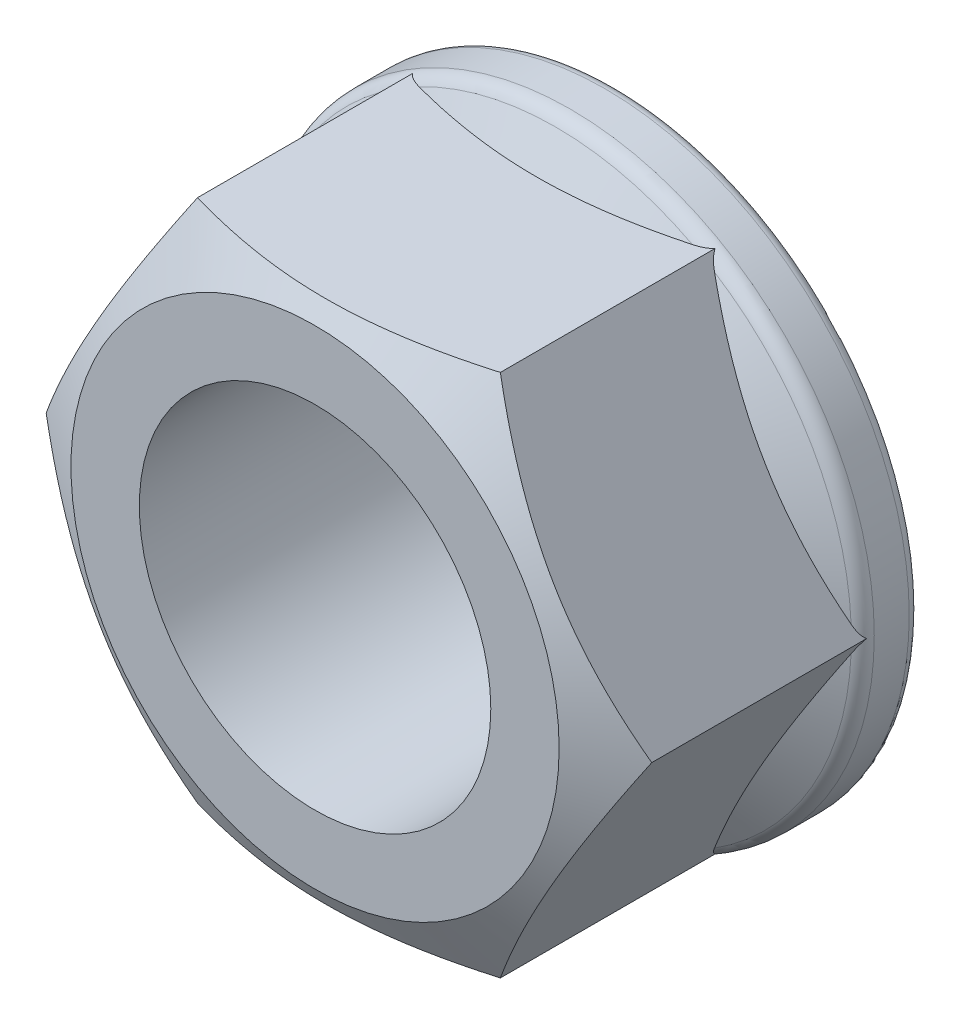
ISO-10303-21;
HEADER;
FILE_DESCRIPTION(('STEP AP214'),'2;1');
FILE_NAME('part.step','',(''),(''),'','','');
FILE_SCHEMA(('AUTOMOTIVE_DESIGN { 1 0 10303 214 1 1 1 1 }'));
ENDSEC;
DATA;
#1=APPLICATION_CONTEXT('core data for automotive mechanical design processes');
#2=APPLICATION_PROTOCOL_DEFINITION('international standard','automotive_design',2000,#1);
#3=PRODUCT_CONTEXT('',#1,'mechanical');
#4=PRODUCT('Part','Part','',(#3));
#5=PRODUCT_RELATED_PRODUCT_CATEGORY('part','',(#4));
#6=PRODUCT_DEFINITION_FORMATION('','',#4);
#7=PRODUCT_DEFINITION_CONTEXT('part definition',#1,'design');
#8=PRODUCT_DEFINITION('design','',#6,#7);
#9=PRODUCT_DEFINITION_SHAPE('','',#8);
#10=(LENGTH_UNIT() NAMED_UNIT(*) SI_UNIT(.MILLI.,.METRE.));
#11=(NAMED_UNIT(*) PLANE_ANGLE_UNIT() SI_UNIT($,.RADIAN.));
#12=(NAMED_UNIT(*) SI_UNIT($,.STERADIAN.) SOLID_ANGLE_UNIT());
#13=UNCERTAINTY_MEASURE_WITH_UNIT(LENGTH_MEASURE(1.E-05),#10,'distance_accuracy_value','');
#14=(GEOMETRIC_REPRESENTATION_CONTEXT(3) GLOBAL_UNCERTAINTY_ASSIGNED_CONTEXT((#13)) GLOBAL_UNIT_ASSIGNED_CONTEXT((#10,
#11,#12)) REPRESENTATION_CONTEXT('',''));
#15=CARTESIAN_POINT('',(0.,0.,0.));
#16=DIRECTION('',(0.,0.,1.));
#17=DIRECTION('',(1.,0.,0.));
#18=AXIS2_PLACEMENT_3D('',#15,#16,#17);
#19=CARTESIAN_POINT('',(0.,0.,2.54));
#20=DIRECTION('',(0.,0.,-1.));
#21=DIRECTION('',(1.,0.,0.));
#22=AXIS2_PLACEMENT_3D('',#19,#20,#21);
#23=CONICAL_SURFACE('',#22,13.843,1.0471975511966);
#24=CARTESIAN_POINT('',(-13.7849304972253,0.000200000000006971,2.573526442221));
#25=CARTESIAN_POINT('',(-13.6334205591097,-0.262222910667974,2.66098604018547));
#26=CARTESIAN_POINT('',(-13.4813457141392,-0.525624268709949,2.74447608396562));
#27=CARTESIAN_POINT('',(-13.1759764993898,-1.0545392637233,2.90241563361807));
#28=CARTESIAN_POINT('',(-13.0226817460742,-1.32005356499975,2.97686216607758));
#29=CARTESIAN_POINT('',(-12.5603274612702,-2.12087467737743,3.18519575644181));
#30=CARTESIAN_POINT('',(-12.2494427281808,-2.65934283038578,3.3036946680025));
#31=CARTESIAN_POINT('',(-11.7842179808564,-3.46513572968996,3.44264525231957));
#32=CARTESIAN_POINT('',(-11.6312678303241,-3.73005316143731,3.48222696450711));
#33=CARTESIAN_POINT('',(-11.3246593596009,-4.26111461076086,3.54860270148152));
#34=CARTESIAN_POINT('',(-11.1710010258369,-4.52725865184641,3.57539648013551));
#35=CARTESIAN_POINT('',(-10.8634281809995,-5.05999044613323,3.61551004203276));
#36=CARTESIAN_POINT('',(-10.7095141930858,-5.32657729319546,3.62884583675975));
#37=CARTESIAN_POINT('',(-10.4015436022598,-5.85999800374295,3.64175925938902));
#38=CARTESIAN_POINT('',(-10.2474870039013,-6.12683185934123,3.64133731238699));
#39=CARTESIAN_POINT('',(-9.95947794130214,-6.62567818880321,3.62769541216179));
#40=CARTESIAN_POINT('',(-9.82550493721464,-6.85772623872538,3.61613947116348));
#41=CARTESIAN_POINT('',(-9.55786706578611,-7.32128863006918,3.58284038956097));
#42=CARTESIAN_POINT('',(-9.42420222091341,-7.55280293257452,3.56109652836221));
#43=CARTESIAN_POINT('',(-9.1572533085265,-8.0151720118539,3.50780069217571));
#44=CARTESIAN_POINT('',(-9.0239696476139,-8.2460260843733,3.47624061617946));
#45=CARTESIAN_POINT('',(-8.75802719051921,-8.70665193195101,3.40386608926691));
#46=CARTESIAN_POINT('',(-8.62536843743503,-8.93642363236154,3.36305100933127));
#47=CARTESIAN_POINT('',(-8.22267534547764,-9.63390852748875,3.22569149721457));
#48=CARTESIAN_POINT('',(-7.95380715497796,-10.0996018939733,3.11545075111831));
#49=CARTESIAN_POINT('',(-7.42007998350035,-11.0240444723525,2.86524918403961));
#50=CARTESIAN_POINT('',(-7.15521416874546,-11.4828055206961,2.72534712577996));
#51=CARTESIAN_POINT('',(-6.89229204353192,-11.9382,2.573526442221));
#52=B_SPLINE_CURVE_WITH_KNOTS('',3,(#24,#25,#26,#27,#28,#29,#30,#31,#32,#33,#34,#35,#36,#37,#38,
#39,#40,#41,#42,#43,#44,#45,#46,#47,#48,#49,#50,#51),.UNSPECIFIED.,.F.,.F.,(4,2,2,2,2,2,2,2,2,2,
2,2,2,4),(0.,0.946091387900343,1.89249300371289,3.78932496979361,4.7144611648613,
5.63961516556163,6.5636671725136,7.48769062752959,8.29208209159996,9.09653045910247,
9.90164448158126,10.7068132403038,12.3525592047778,13.9950747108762),.UNSPECIFIED.);
#53=CARTESIAN_POINT('',(-13.4494632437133,-0.58084632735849,2.75997045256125));
#54=VERTEX_POINT('',#53);
#55=CARTESIAN_POINT('',(-7.22775929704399,-11.3571536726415,2.75997045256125));
#56=VERTEX_POINT('',#55);
#57=EDGE_CURVE('E309',#54,#56,#52,.T.);
#58=ORIENTED_EDGE('',*,*,#57,.F.);
#59=CARTESIAN_POINT('',(0.,0.,2.75997045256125));
#60=DIRECTION('',(0.,0.,-1.));
#61=DIRECTION('',(-1.,0.,0.));
#62=AXIS2_PLACEMENT_3D('',#59,#60,#61);
#63=CIRCLE('',#62,13.462);
#64=EDGE_CURVE('E293',#54,#56,#63,.F.);
#65=ORIENTED_EDGE('',*,*,#64,.T.);
#66=EDGE_LOOP('',(#58,#65));
#67=FACE_BOUND('',#66,.T.);
#68=ADVANCED_FACE('F34',(#67),#23,.T.);
#69=CARTESIAN_POINT('',(-18.085311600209,-11.938,-1.97899302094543));
#70=CARTESIAN_POINT('',(-17.8263048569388,-11.938,-1.85419552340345));
#71=CARTESIAN_POINT('',(-17.5669822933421,-11.938,-1.7300538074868));
#72=CARTESIAN_POINT('',(-17.0476394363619,-11.938,-1.48323141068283));
#73=CARTESIAN_POINT('',(-16.7876191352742,-11.938,-1.36055074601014));
#74=CARTESIAN_POINT('',(-16.0063369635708,-11.938,-0.99488928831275));
#75=CARTESIAN_POINT('',(-15.4839374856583,-11.938,-0.754329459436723));
#76=CARTESIAN_POINT('',(-14.432440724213,-11.938,-0.279816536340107));
#77=CARTESIAN_POINT('',(-13.9033221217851,-11.938,-0.0459105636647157));
#78=CARTESIAN_POINT('',(-12.8407231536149,-11.938,0.411739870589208));
#79=CARTESIAN_POINT('',(-12.3072430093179,-11.938,0.635484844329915));
#80=CARTESIAN_POINT('',(-11.2197140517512,-11.938,1.07633499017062));
#81=CARTESIAN_POINT('',(-10.6655132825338,-11.938,1.29306736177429));
#82=CARTESIAN_POINT('',(-9.55046793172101,-11.938,1.7090670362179));
#83=CARTESIAN_POINT('',(-8.98962259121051,-11.938,1.90833232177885));
#84=CARTESIAN_POINT('',(-7.86161098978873,-11.938,2.2838484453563));
#85=CARTESIAN_POINT('',(-7.29446170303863,-11.938,2.4601498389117));
#86=CARTESIAN_POINT('',(-6.15198848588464,-11.938,2.78380926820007));
#87=CARTESIAN_POINT('',(-5.57666732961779,-11.938,2.93117688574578));
#88=CARTESIAN_POINT('',(-4.7090291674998,-11.938,3.12460338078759));
#89=CARTESIAN_POINT('',(-4.41974492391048,-11.938,3.18436338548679));
#90=CARTESIAN_POINT('',(-3.83928589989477,-11.938,3.29391874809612));
#91=CARTESIAN_POINT('',(-3.54811116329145,-11.938,3.34371433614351));
#92=CARTESIAN_POINT('',(-2.96410139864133,-11.938,3.432438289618));
#93=CARTESIAN_POINT('',(-2.67126636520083,-11.938,3.47136661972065));
#94=CARTESIAN_POINT('',(-2.08428255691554,-11.938,3.53756541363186));
#95=CARTESIAN_POINT('',(-1.79013382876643,-11.938,3.56483628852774));
#96=CARTESIAN_POINT('',(-1.20458280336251,-11.938,3.60685909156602));
#97=CARTESIAN_POINT('',(-0.913191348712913,-11.938,3.62176119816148));
#98=CARTESIAN_POINT('',(-0.330041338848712,-11.938,3.63926841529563));
#99=CARTESIAN_POINT('',(-0.0382827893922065,-11.938,3.64187371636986));
#100=CARTESIAN_POINT('',(0.545088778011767,-11.938,3.63472566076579));
#101=CARTESIAN_POINT('',(0.836701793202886,-11.938,3.62497207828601));
#102=CARTESIAN_POINT('',(1.41927308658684,-11.938,3.59333501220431));
#103=CARTESIAN_POINT('',(1.710231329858,-11.938,3.57145089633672));
#104=CARTESIAN_POINT('',(2.42291989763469,-11.938,3.50343546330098));
#105=CARTESIAN_POINT('',(2.84403994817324,-11.938,3.45080626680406));
#106=CARTESIAN_POINT('',(3.68286777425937,-11.938,3.32311147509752));
#107=CARTESIAN_POINT('',(4.10057501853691,-11.938,3.24804245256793));
#108=CARTESIAN_POINT('',(4.93227729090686,-11.938,3.07813937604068));
#109=CARTESIAN_POINT('',(5.34626890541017,-11.938,2.98328876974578));
#110=CARTESIAN_POINT('',(6.1699646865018,-11.938,2.77668884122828));
#111=CARTESIAN_POINT('',(6.57966894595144,-11.938,2.66493988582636));
#112=CARTESIAN_POINT('',(7.40369336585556,-11.938,2.42462282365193));
#113=CARTESIAN_POINT('',(7.81792219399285,-11.938,2.29574366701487));
#114=CARTESIAN_POINT('',(8.64229788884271,-11.938,2.02559596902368));
#115=CARTESIAN_POINT('',(9.05244472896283,-11.938,1.88432734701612));
#116=CARTESIAN_POINT('',(9.86887617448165,-11.938,1.59156178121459));
#117=CARTESIAN_POINT('',(10.2751622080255,-11.938,1.44006880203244));
#118=CARTESIAN_POINT('',(11.0844300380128,-11.938,1.12854528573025));
#119=CARTESIAN_POINT('',(11.4874118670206,-11.938,0.968514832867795));
#120=CARTESIAN_POINT('',(12.4120242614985,-11.938,0.59182627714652));
#121=CARTESIAN_POINT('',(12.9326438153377,-11.938,0.372690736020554));
#122=CARTESIAN_POINT('',(13.9697600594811,-11.938,-0.075153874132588));
#123=CARTESIAN_POINT('',(14.4862565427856,-11.938,-0.303863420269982));
#124=CARTESIAN_POINT('',(15.5158686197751,-11.938,-0.768997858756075));
#125=CARTESIAN_POINT('',(16.0289835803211,-11.938,-1.00542414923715));
#126=CARTESIAN_POINT('',(17.0522880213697,-11.938,-1.48448904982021));
#127=CARTESIAN_POINT('',(17.5624775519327,-11.938,-1.7271275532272));
#128=CARTESIAN_POINT('',(18.5808813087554,-11.938,-2.21772290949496));
#129=CARTESIAN_POINT('',(19.0890932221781,-11.938,-2.46568455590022));
#130=CARTESIAN_POINT('',(20.1034393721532,-11.938,-2.96582066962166));
#131=CARTESIAN_POINT('',(20.6095736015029,-11.938,-3.21799515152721));
#132=CARTESIAN_POINT('',(21.6200216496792,-11.938,-3.72582983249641));
#133=CARTESIAN_POINT('',(22.1243356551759,-11.938,-3.98148966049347));
#134=CARTESIAN_POINT('',(23.1314535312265,-11.938,-4.49576815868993));
#135=CARTESIAN_POINT('',(23.6342573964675,-11.938,-4.75438683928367));
#136=CARTESIAN_POINT('',(25.0615022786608,-11.938,-5.49299085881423));
#137=CARTESIAN_POINT('',(25.9843955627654,-11.938,-5.97596703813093));
#138=CARTESIAN_POINT('',(27.8268419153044,-11.938,-6.94829908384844));
#139=CARTESIAN_POINT('',(28.7463948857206,-11.938,-7.43765513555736));
#140=CARTESIAN_POINT('',(30.5808954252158,-11.938,-8.42022479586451));
#141=CARTESIAN_POINT('',(31.49584864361,-11.938,-8.9134278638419));
#142=CARTESIAN_POINT('',(32.8666915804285,-11.938,-9.65610683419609));
#143=CARTESIAN_POINT('',(33.3233641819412,-11.938,-9.90413977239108));
#144=CARTESIAN_POINT('',(34.2362385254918,-11.938,-10.4010691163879));
#145=CARTESIAN_POINT('',(34.6924402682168,-11.938,-10.6499655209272));
#146=CARTESIAN_POINT('',(35.1484327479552,-11.938,-10.8992448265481));
#147=B_SPLINE_CURVE_WITH_KNOTS('',3,(#69,#70,#71,#72,#73,#74,#75,#76,#77,#78,#79,#80,#81,#82,
#83,#84,#85,#86,#87,#88,#89,#90,#91,#92,#93,#94,#95,#96,#97,#98,#99,#100,#101,#102,#103,#104,
#105,#106,#107,#108,#109,#110,#111,#112,#113,#114,#115,#116,#117,#118,#119,#120,#121,#122,#123,
#124,#125,#126,#127,#128,#129,#130,#131,#132,#133,#134,#135,#136,#137,#138,#139,#140,#141,#142,
#143,#144,#145,#146),.UNSPECIFIED.,.F.,.F.,(4,2,2,2,2,2,2,2,2,2,2,2,2,2,2,2,2,2,2,2,2,2,2,2,2,2,
2,2,2,2,2,2,2,2,2,2,2,2,4),(0.,0.862512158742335,1.72503388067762,3.45035605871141,
5.18581521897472,6.92118680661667,8.70617999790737,10.4913790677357,12.2725790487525,
14.0531881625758,14.9392212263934,15.825233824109,16.7112493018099,17.5972335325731,
18.472296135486,19.3473451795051,20.2224102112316,21.0975208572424,22.3699950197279,
23.6426636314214,24.9164014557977,26.1901116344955,27.4913226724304,28.7925421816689,
30.0932599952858,31.3939649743,33.0884125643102,34.782944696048,36.4777855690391,
38.1725973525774,39.8690052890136,41.5654191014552,43.2616536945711,44.9578942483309,
48.0827538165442,51.2077043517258,54.3259441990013,55.8849918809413,57.4440372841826),.UNSPECIFIED.);
#148=CARTESIAN_POINT('',(-6.22170394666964,-11.938,2.75997045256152));
#149=VERTEX_POINT('',#148);
#150=CARTESIAN_POINT('',(6.22170394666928,-11.938,2.75997045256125));
#151=VERTEX_POINT('',#150);
#152=EDGE_CURVE('E318',#149,#151,#147,.T.);
#153=ORIENTED_EDGE('',*,*,#152,.F.);
#154=CARTESIAN_POINT('',(0.,0.,2.75997045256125));
#155=DIRECTION('',(0.,0.,-1.));
#156=DIRECTION('',(-1.,0.,0.));
#157=AXIS2_PLACEMENT_3D('',#154,#155,#156);
#158=CIRCLE('',#157,13.462);
#159=EDGE_CURVE('E297',#149,#151,#158,.F.);
#160=ORIENTED_EDGE('',*,*,#159,.T.);
#161=EDGE_LOOP('',(#153,#160));
#162=FACE_BOUND('',#161,.T.);
#163=ADVANCED_FACE('F344',(#162),#23,.T.);
#164=CARTESIAN_POINT('',(6.89229204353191,-11.9382,2.573526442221));
#165=CARTESIAN_POINT('',(7.0438019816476,-11.675777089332,2.66098604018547));
#166=CARTESIAN_POINT('',(7.19587682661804,-11.41237573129,2.74447608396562));
#167=CARTESIAN_POINT('',(7.50124604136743,-10.8834607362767,2.90241563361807));
#168=CARTESIAN_POINT('',(7.65454079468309,-10.6179464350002,2.97686216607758));
#169=CARTESIAN_POINT('',(8.11689507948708,-9.81712532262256,3.18519575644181));
#170=CARTESIAN_POINT('',(8.42777981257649,-9.27865716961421,3.30369466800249));
#171=CARTESIAN_POINT('',(8.89300455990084,-8.47286427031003,3.44264525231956));
#172=CARTESIAN_POINT('',(9.0459547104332,-8.20794683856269,3.48222696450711));
#173=CARTESIAN_POINT('',(9.35256318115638,-7.67688538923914,3.54860270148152));
#174=CARTESIAN_POINT('',(9.50622151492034,-7.41074134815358,3.57539648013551));
#175=CARTESIAN_POINT('',(9.81379435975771,-6.87800955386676,3.61551004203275));
#176=CARTESIAN_POINT('',(9.9677083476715,-6.61142270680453,3.62884583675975));
#177=CARTESIAN_POINT('',(10.2756789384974,-6.07800199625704,3.64175925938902));
#178=CARTESIAN_POINT('',(10.429735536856,-5.81116814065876,3.64133731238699));
#179=CARTESIAN_POINT('',(10.7177445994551,-5.31232181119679,3.62769541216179));
#180=CARTESIAN_POINT('',(10.8517176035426,-5.08027376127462,3.61613947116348));
#181=CARTESIAN_POINT('',(11.1193554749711,-4.61671136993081,3.58284038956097));
#182=CARTESIAN_POINT('',(11.2530203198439,-4.38519706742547,3.56109652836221));
#183=CARTESIAN_POINT('',(11.5199692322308,-3.92282798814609,3.50780069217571));
#184=CARTESIAN_POINT('',(11.6532528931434,-3.69197391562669,3.47624061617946));
#185=CARTESIAN_POINT('',(11.919195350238,-3.23134806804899,3.40386608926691));
#186=CARTESIAN_POINT('',(12.0518541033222,-3.00157636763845,3.36305100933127));
#187=CARTESIAN_POINT('',(12.4545471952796,-2.30409147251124,3.22569149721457));
#188=CARTESIAN_POINT('',(12.7234153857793,-1.83839810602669,3.11545075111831));
#189=CARTESIAN_POINT('',(13.2571425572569,-0.913955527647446,2.86524918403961));
#190=CARTESIAN_POINT('',(13.5220083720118,-0.455194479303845,2.72534712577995));
#191=CARTESIAN_POINT('',(13.7849304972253,0.00020000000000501,2.573526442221));
#192=B_SPLINE_CURVE_WITH_KNOTS('',3,(#164,#165,#166,#167,#168,#169,#170,#171,#172,#173,#174,
#175,#176,#177,#178,#179,#180,#181,#182,#183,#184,#185,#186,#187,#188,#189,#190,#191),
.UNSPECIFIED.,.F.,.F.,(4,2,2,2,2,2,2,2,2,2,2,2,2,4),(0.,0.946091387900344,1.89249300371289,
3.78932496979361,4.7144611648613,5.63961516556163,6.5636671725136,7.48769062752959,
8.29208209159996,9.09653045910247,9.90164448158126,10.7068132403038,12.3525592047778,
13.9950747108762),.UNSPECIFIED.);
#193=CARTESIAN_POINT('',(7.22775929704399,-11.3571536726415,2.75997045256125));
#194=VERTEX_POINT('',#193);
#195=CARTESIAN_POINT('',(13.4494632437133,-0.580846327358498,2.75997045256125));
#196=VERTEX_POINT('',#195);
#197=EDGE_CURVE('E415',#194,#196,#192,.T.);
#198=ORIENTED_EDGE('',*,*,#197,.F.);
#199=CARTESIAN_POINT('',(0.,0.,2.75997045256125));
#200=DIRECTION('',(0.,0.,-1.));
#201=DIRECTION('',(-1.,0.,0.));
#202=AXIS2_PLACEMENT_3D('',#199,#200,#201);
#203=CIRCLE('',#202,13.462);
#204=EDGE_CURVE('E301',#194,#196,#203,.F.);
#205=ORIENTED_EDGE('',*,*,#204,.T.);
#206=EDGE_LOOP('',(#198,#205));
#207=FACE_BOUND('',#206,.T.);
#208=ADVANCED_FACE('F350',(#207),#23,.T.);
#209=CARTESIAN_POINT('',(13.7849304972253,-0.0001999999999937,2.573526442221));
#210=CARTESIAN_POINT('',(13.6334205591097,0.262222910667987,2.66098604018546));
#211=CARTESIAN_POINT('',(13.4813457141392,0.525624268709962,2.74447608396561));
#212=CARTESIAN_POINT('',(13.1759764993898,1.05453926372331,2.90241563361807));
#213=CARTESIAN_POINT('',(13.0226817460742,1.32005356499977,2.97686216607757));
#214=CARTESIAN_POINT('',(12.5603274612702,2.12087467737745,3.18519575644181));
#215=CARTESIAN_POINT('',(12.2494427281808,2.6593428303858,3.30369466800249));
#216=CARTESIAN_POINT('',(11.7842179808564,3.46513572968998,3.44264525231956));
#217=CARTESIAN_POINT('',(11.6312678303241,3.73005316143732,3.48222696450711));
#218=CARTESIAN_POINT('',(11.3246593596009,4.26111461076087,3.54860270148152));
#219=CARTESIAN_POINT('',(11.1710010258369,4.52725865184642,3.5753964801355));
#220=CARTESIAN_POINT('',(10.8634281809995,5.05999044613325,3.61551004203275));
#221=CARTESIAN_POINT('',(10.7095141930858,5.32657729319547,3.62884583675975));
#222=CARTESIAN_POINT('',(10.4015436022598,5.85999800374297,3.64175925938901));
#223=CARTESIAN_POINT('',(10.2474870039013,6.12683185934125,3.64133731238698));
#224=CARTESIAN_POINT('',(9.95947794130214,6.62567818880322,3.62769541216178));
#225=CARTESIAN_POINT('',(9.82550493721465,6.85772623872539,3.61613947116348));
#226=CARTESIAN_POINT('',(9.55786706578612,7.32128863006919,3.58284038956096));
#227=CARTESIAN_POINT('',(9.42420222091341,7.55280293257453,3.56109652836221));
#228=CARTESIAN_POINT('',(9.1572533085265,8.01517201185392,3.5078006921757));
#229=CARTESIAN_POINT('',(9.02396964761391,8.24602608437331,3.47624061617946));
#230=CARTESIAN_POINT('',(8.75802719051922,8.70665193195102,3.4038660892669));
#231=CARTESIAN_POINT('',(8.62536843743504,8.93642363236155,3.36305100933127));
#232=CARTESIAN_POINT('',(8.22267534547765,9.63390852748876,3.22569149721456));
#233=CARTESIAN_POINT('',(7.95380715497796,10.0996018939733,3.1154507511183));
#234=CARTESIAN_POINT('',(7.42007998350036,11.0240444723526,2.8652491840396));
#235=CARTESIAN_POINT('',(7.15521416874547,11.4828055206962,2.72534712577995));
#236=CARTESIAN_POINT('',(6.89229204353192,11.9382,2.573526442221));
#237=B_SPLINE_CURVE_WITH_KNOTS('',3,(#209,#210,#211,#212,#213,#214,#215,#216,#217,#218,#219,
#220,#221,#222,#223,#224,#225,#226,#227,#228,#229,#230,#231,#232,#233,#234,#235,#236),
.UNSPECIFIED.,.F.,.F.,(4,2,2,2,2,2,2,2,2,2,2,2,2,4),(0.,0.946091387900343,1.89249300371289,
3.78932496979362,4.7144611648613,5.63961516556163,6.5636671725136,7.48769062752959,
8.29208209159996,9.09653045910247,9.90164448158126,10.7068132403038,12.3525592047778,
13.9950747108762),.UNSPECIFIED.);
#238=CARTESIAN_POINT('',(13.4494632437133,0.580846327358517,2.75997045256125));
#239=VERTEX_POINT('',#238);
#240=CARTESIAN_POINT('',(7.227759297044,11.3571536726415,2.75997045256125));
#241=VERTEX_POINT('',#240);
#242=EDGE_CURVE('E373',#239,#241,#237,.T.);
#243=ORIENTED_EDGE('',*,*,#242,.F.);
#244=CARTESIAN_POINT('',(0.,0.,2.75997045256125));
#245=DIRECTION('',(0.,0.,-1.));
#246=DIRECTION('',(-1.,0.,0.));
#247=AXIS2_PLACEMENT_3D('',#244,#245,#246);
#248=CIRCLE('',#247,13.462);
#249=EDGE_CURVE('E303',#239,#241,#248,.F.);
#250=ORIENTED_EDGE('',*,*,#249,.T.);
#251=EDGE_LOOP('',(#243,#250));
#252=FACE_BOUND('',#251,.T.);
#253=ADVANCED_FACE('F363',(#252),#23,.T.);
#254=CARTESIAN_POINT('',(-18.085311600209,11.938,-1.97899302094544));
#255=CARTESIAN_POINT('',(-17.8263048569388,11.938,-1.85419552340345));
#256=CARTESIAN_POINT('',(-17.5669822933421,11.938,-1.73005380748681));
#257=CARTESIAN_POINT('',(-17.0476394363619,11.938,-1.48323141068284));
#258=CARTESIAN_POINT('',(-16.7876191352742,11.938,-1.36055074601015));
#259=CARTESIAN_POINT('',(-16.0063369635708,11.938,-0.994889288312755));
#260=CARTESIAN_POINT('',(-15.4839374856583,11.938,-0.754329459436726));
#261=CARTESIAN_POINT('',(-14.432440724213,11.938,-0.279816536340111));
#262=CARTESIAN_POINT('',(-13.9033221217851,11.938,-0.0459105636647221));
#263=CARTESIAN_POINT('',(-12.8407231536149,11.938,0.4117398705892));
#264=CARTESIAN_POINT('',(-12.3072430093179,11.938,0.635484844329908));
#265=CARTESIAN_POINT('',(-11.2197140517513,11.938,1.07633499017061));
#266=CARTESIAN_POINT('',(-10.6655132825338,11.938,1.29306736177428));
#267=CARTESIAN_POINT('',(-9.55046793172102,11.938,1.7090670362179));
#268=CARTESIAN_POINT('',(-8.98962259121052,11.938,1.90833232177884));
#269=CARTESIAN_POINT('',(-7.86161098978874,11.938,2.28384844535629));
#270=CARTESIAN_POINT('',(-7.29446170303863,11.938,2.46014983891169));
#271=CARTESIAN_POINT('',(-6.15198848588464,11.938,2.78380926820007));
#272=CARTESIAN_POINT('',(-5.57666732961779,11.938,2.93117688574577));
#273=CARTESIAN_POINT('',(-4.7090291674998,11.938,3.12460338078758));
#274=CARTESIAN_POINT('',(-4.41974492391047,11.938,3.18436338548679));
#275=CARTESIAN_POINT('',(-3.83928589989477,11.938,3.29391874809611));
#276=CARTESIAN_POINT('',(-3.54811116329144,11.938,3.3437143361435));
#277=CARTESIAN_POINT('',(-2.96410139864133,11.938,3.43243828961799));
#278=CARTESIAN_POINT('',(-2.67126636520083,11.938,3.47136661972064));
#279=CARTESIAN_POINT('',(-2.08428255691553,11.938,3.53756541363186));
#280=CARTESIAN_POINT('',(-1.79013382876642,11.938,3.56483628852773));
#281=CARTESIAN_POINT('',(-1.2045828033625,11.938,3.60685909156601));
#282=CARTESIAN_POINT('',(-0.913191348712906,11.938,3.62176119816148));
#283=CARTESIAN_POINT('',(-0.330041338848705,11.938,3.63926841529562));
#284=CARTESIAN_POINT('',(-0.0382827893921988,11.938,3.64187371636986));
#285=CARTESIAN_POINT('',(0.545088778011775,11.938,3.63472566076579));
#286=CARTESIAN_POINT('',(0.836701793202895,11.938,3.62497207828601));
#287=CARTESIAN_POINT('',(1.41927308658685,11.938,3.5933350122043));
#288=CARTESIAN_POINT('',(1.710231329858,11.938,3.57145089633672));
#289=CARTESIAN_POINT('',(2.4229198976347,11.938,3.50343546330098));
#290=CARTESIAN_POINT('',(2.84403994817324,11.938,3.45080626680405));
#291=CARTESIAN_POINT('',(3.68286777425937,11.938,3.32311147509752));
#292=CARTESIAN_POINT('',(4.10057501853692,11.938,3.24804245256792));
#293=CARTESIAN_POINT('',(4.93227729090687,11.938,3.07813937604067));
#294=CARTESIAN_POINT('',(5.34626890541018,11.938,2.98328876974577));
#295=CARTESIAN_POINT('',(6.16996468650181,11.938,2.77668884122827));
#296=CARTESIAN_POINT('',(6.57966894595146,11.938,2.66493988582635));
#297=CARTESIAN_POINT('',(7.40369336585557,11.938,2.42462282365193));
#298=CARTESIAN_POINT('',(7.81792219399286,11.938,2.29574366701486));
#299=CARTESIAN_POINT('',(8.64229788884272,11.938,2.02559596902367));
#300=CARTESIAN_POINT('',(9.05244472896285,11.938,1.88432734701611));
#301=CARTESIAN_POINT('',(9.86887617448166,11.938,1.59156178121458));
#302=CARTESIAN_POINT('',(10.2751622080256,11.938,1.44006880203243));
#303=CARTESIAN_POINT('',(11.0844300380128,11.938,1.12854528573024));
#304=CARTESIAN_POINT('',(11.4874118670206,11.938,0.968514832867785));
#305=CARTESIAN_POINT('',(12.4120242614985,11.938,0.591826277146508));
#306=CARTESIAN_POINT('',(12.9326438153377,11.938,0.372690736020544));
#307=CARTESIAN_POINT('',(13.9697600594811,11.938,-0.0751538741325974));
#308=CARTESIAN_POINT('',(14.4862565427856,11.938,-0.303863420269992));
#309=CARTESIAN_POINT('',(15.5158686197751,11.938,-0.768997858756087));
#310=CARTESIAN_POINT('',(16.0289835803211,11.938,-1.00542414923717));
#311=CARTESIAN_POINT('',(17.0522880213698,11.938,-1.48448904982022));
#312=CARTESIAN_POINT('',(17.5624775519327,11.938,-1.72712755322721));
#313=CARTESIAN_POINT('',(18.5808813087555,11.938,-2.21772290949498));
#314=CARTESIAN_POINT('',(19.0890932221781,11.938,-2.46568455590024));
#315=CARTESIAN_POINT('',(20.1034393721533,11.938,-2.96582066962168));
#316=CARTESIAN_POINT('',(20.609573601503,11.938,-3.21799515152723));
#317=CARTESIAN_POINT('',(21.6200216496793,11.938,-3.72582983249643));
#318=CARTESIAN_POINT('',(22.1243356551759,11.938,-3.98148966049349));
#319=CARTESIAN_POINT('',(23.1314535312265,11.938,-4.49576815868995));
#320=CARTESIAN_POINT('',(23.6342573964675,11.938,-4.75438683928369));
#321=CARTESIAN_POINT('',(25.0615022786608,11.938,-5.49299085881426));
#322=CARTESIAN_POINT('',(25.9843955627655,11.938,-5.97596703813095));
#323=CARTESIAN_POINT('',(27.8268419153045,11.938,-6.94829908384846));
#324=CARTESIAN_POINT('',(28.7463948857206,11.938,-7.43765513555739));
#325=CARTESIAN_POINT('',(30.5808954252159,11.938,-8.42022479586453));
#326=CARTESIAN_POINT('',(31.49584864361,11.938,-8.91342786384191));
#327=CARTESIAN_POINT('',(32.8666915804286,11.938,-9.65610683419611));
#328=CARTESIAN_POINT('',(33.3233641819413,11.938,-9.90413977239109));
#329=CARTESIAN_POINT('',(34.2362385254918,11.938,-10.4010691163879));
#330=CARTESIAN_POINT('',(34.6924402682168,11.938,-10.6499655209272));
#331=CARTESIAN_POINT('',(35.1484327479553,11.938,-10.8992448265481));
#332=B_SPLINE_CURVE_WITH_KNOTS('',3,(#254,#255,#256,#257,#258,#259,#260,#261,#262,#263,#264,
#265,#266,#267,#268,#269,#270,#271,#272,#273,#274,#275,#276,#277,#278,#279,#280,#281,#282,#283,
#284,#285,#286,#287,#288,#289,#290,#291,#292,#293,#294,#295,#296,#297,#298,#299,#300,#301,#302,
#303,#304,#305,#306,#307,#308,#309,#310,#311,#312,#313,#314,#315,#316,#317,#318,#319,#320,#321,
#322,#323,#324,#325,#326,#327,#328,#329,#330,#331),.UNSPECIFIED.,.F.,.F.,(4,2,2,2,2,2,2,2,2,2,2,
2,2,2,2,2,2,2,2,2,2,2,2,2,2,2,2,2,2,2,2,2,2,2,2,2,2,2,4),(0.,0.862512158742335,1.72503388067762,
3.45035605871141,5.18581521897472,6.92118680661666,8.70617999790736,10.4913790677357,
12.2725790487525,14.0531881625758,14.9392212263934,15.825233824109,16.7112493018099,
17.5972335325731,18.4722961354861,19.3473451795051,20.2224102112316,21.0975208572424,
22.3699950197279,23.6426636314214,24.9164014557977,26.1901116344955,27.4913226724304,
28.792542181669,30.0932599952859,31.3939649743,33.0884125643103,34.7829446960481,
36.4777855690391,38.1725973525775,39.8690052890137,41.5654191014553,43.2616536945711,
44.9578942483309,48.0827538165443,51.2077043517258,54.3259441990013,55.8849918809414,
57.4440372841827),.UNSPECIFIED.);
#333=CARTESIAN_POINT('',(6.22170394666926,11.938,2.75997045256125));
#334=VERTEX_POINT('',#333);
#335=CARTESIAN_POINT('',(-6.22170394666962,11.938,2.75997045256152));
#336=VERTEX_POINT('',#335);
#337=EDGE_CURVE('E165',#334,#336,#332,.F.);
#338=ORIENTED_EDGE('',*,*,#337,.F.);
#339=CARTESIAN_POINT('',(0.,0.,2.75997045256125));
#340=DIRECTION('',(0.,0.,-1.));
#341=DIRECTION('',(-1.,0.,0.));
#342=AXIS2_PLACEMENT_3D('',#339,#340,#341);
#343=CIRCLE('',#342,13.462);
#344=EDGE_CURVE('E305',#334,#336,#343,.F.);
#345=ORIENTED_EDGE('',*,*,#344,.T.);
#346=EDGE_LOOP('',(#338,#345));
#347=FACE_BOUND('',#346,.T.);
#348=ADVANCED_FACE('F355',(#347),#23,.T.);
#349=CARTESIAN_POINT('',(0.,0.,0.));
#350=DIRECTION('',(0.,0.,1.));
#351=DIRECTION('',(1.,0.,0.));
#352=AXIS2_PLACEMENT_3D('',#349,#350,#351);
#353=PLANE('',#352);
#354=CARTESIAN_POINT('',(0.,0.,0.));
#355=DIRECTION('',(0.,0.,1.));
#356=DIRECTION('',(1.,0.,0.));
#357=AXIS2_PLACEMENT_3D('',#354,#355,#356);
#358=CIRCLE('',#357,13.335);
#359=CARTESIAN_POINT('',(13.335,0.,0.));
#360=VERTEX_POINT('',#359);
#361=EDGE_CURVE('E12',#360,#360,#358,.F.);
#362=ORIENTED_EDGE('',*,*,#361,.T.);
#363=EDGE_LOOP('',(#362));
#364=FACE_BOUND('',#363,.T.);
#365=CARTESIAN_POINT('',(0.,0.,0.));
#366=DIRECTION('',(0.,0.,1.));
#367=DIRECTION('',(1.,0.,0.));
#368=AXIS2_PLACEMENT_3D('',#365,#366,#367);
#369=CIRCLE('',#368,8.001);
#370=CARTESIAN_POINT('',(8.001,0.,0.));
#371=VERTEX_POINT('',#370);
#372=EDGE_CURVE('E313',#371,#371,#369,.T.);
#373=ORIENTED_EDGE('',*,*,#372,.T.);
#374=EDGE_LOOP('',(#373));
#375=FACE_BOUND('',#374,.T.);
#376=ADVANCED_FACE('F362',(#364,#375),#353,.F.);
#377=CARTESIAN_POINT('',(0.,0.,13.716));
#378=DIRECTION('',(0.,0.,1.));
#379=DIRECTION('',(1.,0.,0.));
#380=AXIS2_PLACEMENT_3D('',#377,#378,#379);
#381=PLANE('',#380);
#382=CARTESIAN_POINT('',(0.,0.,13.716));
#383=DIRECTION('',(0.,0.,1.));
#384=DIRECTION('',(1.,0.,0.));
#385=AXIS2_PLACEMENT_3D('',#382,#383,#384);
#386=CIRCLE('',#385,11.1125);
#387=CARTESIAN_POINT('',(11.1125,0.,13.716));
#388=VERTEX_POINT('',#387);
#389=EDGE_CURVE('E129',#388,#388,#386,.T.);
#390=ORIENTED_EDGE('',*,*,#389,.T.);
#391=EDGE_LOOP('',(#390));
#392=FACE_BOUND('',#391,.T.);
#393=CARTESIAN_POINT('',(0.,0.,13.716));
#394=DIRECTION('',(0.,0.,1.));
#395=DIRECTION('',(1.,0.,0.));
#396=AXIS2_PLACEMENT_3D('',#393,#394,#395);
#397=CIRCLE('',#396,8.001);
#398=CARTESIAN_POINT('',(8.001,0.,13.716));
#399=VERTEX_POINT('',#398);
#400=EDGE_CURVE('E310',#399,#399,#397,.F.);
#401=ORIENTED_EDGE('',*,*,#400,.T.);
#402=EDGE_LOOP('',(#401));
#403=FACE_BOUND('',#402,.T.);
#404=ADVANCED_FACE('F178',(#392,#403),#381,.T.);
#405=CARTESIAN_POINT('',(-13.7848150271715,0.,13.716));
#406=DIRECTION('',(0.866025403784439,0.5,0.));
#407=DIRECTION('',(-0.5,0.866025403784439,0.));
#408=AXIS2_PLACEMENT_3D('',#405,#406,#407);
#409=PLANE('',#408);
#410=CARTESIAN_POINT('',(-13.7849304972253,0.000200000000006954,12.1730715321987));
#411=CARTESIAN_POINT('',(-13.6334205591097,-0.262222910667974,12.2605311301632));
#412=CARTESIAN_POINT('',(-13.4813457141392,-0.525624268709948,12.3440211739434));
#413=CARTESIAN_POINT('',(-13.1759764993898,-1.05453926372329,12.5019607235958));
#414=CARTESIAN_POINT('',(-13.0226817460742,-1.32005356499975,12.5764072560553));
#415=CARTESIAN_POINT('',(-12.5603274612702,-2.12087467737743,12.7847408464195));
#416=CARTESIAN_POINT('',(-12.2494427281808,-2.65934283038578,12.9032397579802));
#417=CARTESIAN_POINT('',(-11.7842179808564,-3.46513572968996,13.0421903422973));
#418=CARTESIAN_POINT('',(-11.6312678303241,-3.73005316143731,13.0817720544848));
#419=CARTESIAN_POINT('',(-11.3246593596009,-4.26111461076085,13.1481477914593));
#420=CARTESIAN_POINT('',(-11.1710010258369,-4.52725865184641,13.1749415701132));
#421=CARTESIAN_POINT('',(-10.8634281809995,-5.05999044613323,13.2150551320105));
#422=CARTESIAN_POINT('',(-10.7095141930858,-5.32657729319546,13.2283909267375));
#423=CARTESIAN_POINT('',(-10.4015436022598,-5.85999800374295,13.2413043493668));
#424=CARTESIAN_POINT('',(-10.2474870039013,-6.12683185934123,13.2408824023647));
#425=CARTESIAN_POINT('',(-9.95947794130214,-6.6256781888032,13.2272405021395));
#426=CARTESIAN_POINT('',(-9.82550493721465,-6.85772623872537,13.2156845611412));
#427=CARTESIAN_POINT('',(-9.55786706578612,-7.32128863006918,13.1823854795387));
#428=CARTESIAN_POINT('',(-9.42420222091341,-7.55280293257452,13.1606416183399));
#429=CARTESIAN_POINT('',(-9.1572533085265,-8.0151720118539,13.1073457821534));
#430=CARTESIAN_POINT('',(-9.0239696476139,-8.2460260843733,13.0757857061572));
#431=CARTESIAN_POINT('',(-8.75802719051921,-8.706651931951,13.0034111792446));
#432=CARTESIAN_POINT('',(-8.62536843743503,-8.93642363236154,12.962596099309));
#433=CARTESIAN_POINT('',(-8.22267534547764,-9.63390852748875,12.8252365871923));
#434=CARTESIAN_POINT('',(-7.95380715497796,-10.0996018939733,12.714995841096));
#435=CARTESIAN_POINT('',(-7.42007998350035,-11.0240444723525,12.4647942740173));
#436=CARTESIAN_POINT('',(-7.15521416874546,-11.4828055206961,12.3248922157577));
#437=CARTESIAN_POINT('',(-6.89229204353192,-11.9382,12.1730715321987));
#438=B_SPLINE_CURVE_WITH_KNOTS('',3,(#410,#411,#412,#413,#414,#415,#416,#417,#418,#419,#420,
#421,#422,#423,#424,#425,#426,#427,#428,#429,#430,#431,#432,#433,#434,#435,#436,#437),
.UNSPECIFIED.,.F.,.F.,(4,2,2,2,2,2,2,2,2,2,2,2,2,4),(0.,0.946091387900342,1.89249300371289,
3.78932496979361,4.7144611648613,5.63961516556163,6.56366717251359,7.48769062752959,
8.29208209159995,9.09653045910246,9.90164448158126,10.7068132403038,12.3525592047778,
13.9950747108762),.UNSPECIFIED.);
#439=CARTESIAN_POINT('',(-13.7848150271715,0.,12.1731381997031));
#440=VERTEX_POINT('',#439);
#441=CARTESIAN_POINT('',(-6.89240751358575,-11.938,12.1731381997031));
#442=VERTEX_POINT('',#441);
#443=EDGE_CURVE('E125',#440,#442,#438,.T.);
#444=ORIENTED_EDGE('',*,*,#443,.F.);
#445=DIRECTION('',(0.,0.,-1.));
#446=VECTOR('',#445,1.);
#447=CARTESIAN_POINT('',(-13.7848150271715,0.,13.716));
#448=LINE('',#447,#446);
#449=CARTESIAN_POINT('',(-13.7848150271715,0.,2.3921008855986));
#450=VERTEX_POINT('',#449);
#451=EDGE_CURVE('E49',#440,#450,#448,.T.);
#452=ORIENTED_EDGE('',*,*,#451,.T.);
#453=CARTESIAN_POINT('',(-13.7848150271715,0.,2.3921008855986));
#454=CARTESIAN_POINT('',(-13.7760935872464,-0.0151059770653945,2.41309093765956));
#455=CARTESIAN_POINT('',(-13.7667429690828,-0.0313017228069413,2.43294489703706));
#456=CARTESIAN_POINT('',(-13.7470799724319,-0.065359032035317,2.47051647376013));
#457=CARTESIAN_POINT('',(-13.7367710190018,-0.0832146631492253,2.48824121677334));
#458=CARTESIAN_POINT('',(-13.7051481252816,-0.137987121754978,2.53800231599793));
#459=CARTESIAN_POINT('',(-13.6827946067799,-0.176704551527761,2.56738781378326));
#460=CARTESIAN_POINT('',(-13.6434586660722,-0.244836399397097,2.61233627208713));
#461=CARTESIAN_POINT('',(-13.6268825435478,-0.273547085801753,2.62939853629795));
#462=CARTESIAN_POINT('',(-13.5931435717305,-0.331984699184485,2.66106866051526));
#463=CARTESIAN_POINT('',(-13.5759804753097,-0.361712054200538,2.67567547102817));
#464=CARTESIAN_POINT('',(-13.5407647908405,-0.422707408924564,2.70310694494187));
#465=CARTESIAN_POINT('',(-13.5227007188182,-0.453995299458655,2.7158716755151));
#466=CARTESIAN_POINT('',(-13.4862809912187,-0.517076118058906,2.73936876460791));
#467=CARTESIAN_POINT('',(-13.4679259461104,-0.548867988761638,2.75010489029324));
#468=CARTESIAN_POINT('',(-13.4494632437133,-0.580846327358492,2.75997045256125));
#469=B_SPLINE_CURVE_WITH_KNOTS('',3,(#453,#454,#455,#456,#457,#458,#459,#460,#461,#462,#463,
#464,#465,#466,#467,#468),.UNSPECIFIED.,.F.,.F.,(4,2,2,2,2,2,2,4),(0.,0.0817178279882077,
0.163154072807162,0.32299519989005,0.434768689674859,0.546589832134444,0.661480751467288,
0.776156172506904),.UNSPECIFIED.);
#470=EDGE_CURVE('E330',#450,#54,#469,.T.);
#471=ORIENTED_EDGE('',*,*,#470,.T.);
#472=ORIENTED_EDGE('',*,*,#57,.T.);
#473=CARTESIAN_POINT('',(-7.22775929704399,-11.3571536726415,2.75997045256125));
#474=CARTESIAN_POINT('',(-7.20730762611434,-11.3925770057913,2.74903634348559));
#475=CARTESIAN_POINT('',(-7.18698340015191,-11.4277795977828,2.73703910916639));
#476=CARTESIAN_POINT('',(-7.14667657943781,-11.4975930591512,2.71050528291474));
#477=CARTESIAN_POINT('',(-7.12669544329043,-11.5322014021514,2.6959598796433));
#478=CARTESIAN_POINT('',(-7.08792708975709,-11.5993501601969,2.66449098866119));
#479=CARTESIAN_POINT('',(-7.06912208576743,-11.6319213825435,2.64765661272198));
#480=CARTESIAN_POINT('',(-7.0323166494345,-11.6956702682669,2.61086229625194));
#481=CARTESIAN_POINT('',(-7.0143152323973,-11.7268496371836,2.59090632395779));
#482=CARTESIAN_POINT('',(-6.97762078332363,-11.7904062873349,2.5450062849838));
#483=CARTESIAN_POINT('',(-6.95905051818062,-11.8225709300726,2.51865530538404));
#484=CARTESIAN_POINT('',(-6.93271607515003,-11.8681835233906,2.47485689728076));
#485=CARTESIAN_POINT('',(-6.92412616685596,-11.8830616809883,2.45939767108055));
#486=CARTESIAN_POINT('',(-6.90767198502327,-11.9115611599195,2.42693369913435));
#487=CARTESIAN_POINT('',(-6.89980956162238,-11.9251792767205,2.40992521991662));
#488=CARTESIAN_POINT('',(-6.89240751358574,-11.938,2.39210088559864));
#489=B_SPLINE_CURVE_WITH_KNOTS('',3,(#473,#474,#475,#476,#477,#478,#479,#480,#481,#482,#483,
#484,#485,#486,#487,#488),.UNSPECIFIED.,.F.,.F.,(4,2,2,2,2,2,2,4),(0.,0.127046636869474,
0.254541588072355,0.378029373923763,0.501361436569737,0.63751969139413,0.706767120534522,
0.776186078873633),.UNSPECIFIED.);
#490=CARTESIAN_POINT('',(-6.89240751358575,-11.938,2.3921008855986));
#491=VERTEX_POINT('',#490);
#492=EDGE_CURVE('E215',#56,#491,#489,.T.);
#493=ORIENTED_EDGE('',*,*,#492,.T.);
#494=DIRECTION('',(0.,0.,-1.));
#495=VECTOR('',#494,1.);
#496=CARTESIAN_POINT('',(-6.89240751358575,-11.938,13.716));
#497=LINE('',#496,#495);
#498=EDGE_CURVE('E134',#442,#491,#497,.T.);
#499=ORIENTED_EDGE('',*,*,#498,.F.);
#500=EDGE_LOOP('',(#444,#452,#471,#472,#493,#499));
#501=FACE_BOUND('',#500,.T.);
#502=ADVANCED_FACE('F132',(#501),#409,.F.);
#503=CARTESIAN_POINT('',(-6.89240751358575,-11.938,13.716));
#504=DIRECTION('',(0.,1.,0.));
#505=DIRECTION('',(-1.,0.,0.));
#506=AXIS2_PLACEMENT_3D('',#503,#504,#505);
#507=PLANE('',#506);
#508=CARTESIAN_POINT('',(-18.4260868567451,-11.938,7.45588910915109));
#509=CARTESIAN_POINT('',(-18.1656618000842,-11.938,7.58207376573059));
#510=CARTESIAN_POINT('',(-17.9049286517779,-11.938,7.70762226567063));
#511=CARTESIAN_POINT('',(-17.3827818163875,-11.938,7.95730263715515));
#512=CARTESIAN_POINT('',(-17.1213681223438,-11.938,8.08143449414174));
#513=CARTESIAN_POINT('',(-16.3359387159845,-11.938,8.45152197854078));
#514=CARTESIAN_POINT('',(-15.8108132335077,-11.938,8.69513135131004));
#515=CARTESIAN_POINT('',(-14.7541185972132,-11.938,9.17593177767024));
#516=CARTESIAN_POINT('',(-14.2225298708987,-11.938,9.41307991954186));
#517=CARTESIAN_POINT('',(-13.1550917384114,-11.938,9.87755084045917));
#518=CARTESIAN_POINT('',(-12.6192425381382,-11.938,10.1048740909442));
#519=CARTESIAN_POINT('',(-11.5258683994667,-11.938,10.5538925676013));
#520=CARTESIAN_POINT('',(-10.9681834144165,-11.938,10.7752001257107));
#521=CARTESIAN_POINT('',(-9.84625386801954,-11.938,11.2008530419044));
#522=CARTESIAN_POINT('',(-9.28200857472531,-11.938,11.405196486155));
#523=CARTESIAN_POINT('',(-8.14716228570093,-11.938,11.7914922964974));
#524=CARTESIAN_POINT('',(-7.57657707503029,-11.938,11.9734906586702));
#525=CARTESIAN_POINT('',(-6.42717095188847,-11.938,12.3092103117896));
#526=CARTESIAN_POINT('',(-5.84835272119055,-11.938,12.462940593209));
#527=CARTESIAN_POINT('',(-4.97535179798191,-11.938,12.6663374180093));
#528=CARTESIAN_POINT('',(-4.68428897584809,-11.938,12.7294791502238));
#529=CARTESIAN_POINT('',(-4.10019119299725,-11.938,12.8459213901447));
#530=CARTESIAN_POINT('',(-3.80715627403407,-11.938,12.899222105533));
#531=CARTESIAN_POINT('',(-3.21932448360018,-11.938,12.9950358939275));
#532=CARTESIAN_POINT('',(-2.92452764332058,-11.938,13.0375491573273));
#533=CARTESIAN_POINT('',(-2.33348998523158,-11.938,13.1109371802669));
#534=CARTESIAN_POINT('',(-2.03724922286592,-11.938,13.1418123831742));
#535=CARTESIAN_POINT('',(-1.44756789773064,-11.938,13.1909286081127));
#536=CARTESIAN_POINT('',(-1.15414057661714,-11.938,13.2093276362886));
#537=CARTESIAN_POINT('',(-0.566771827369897,-11.938,13.2337066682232));
#538=CARTESIAN_POINT('',(-0.272830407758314,-11.938,13.2396868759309));
#539=CARTESIAN_POINT('',(0.315048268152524,-11.938,13.2390862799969));
#540=CARTESIAN_POINT('',(0.608985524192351,-11.938,13.2325051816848));
#541=CARTESIAN_POINT('',(1.19632371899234,-11.938,13.2069407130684));
#542=CARTESIAN_POINT('',(1.48972463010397,-11.938,13.1879567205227));
#543=CARTESIAN_POINT('',(2.19723457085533,-11.938,13.1276226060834));
#544=CARTESIAN_POINT('',(2.61084109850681,-11.938,13.0802565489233));
#545=CARTESIAN_POINT('',(3.43490962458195,-11.938,12.9634788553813));
#546=CARTESIAN_POINT('',(3.84537117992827,-11.938,12.8940641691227));
#547=CARTESIAN_POINT('',(5.07158429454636,-11.938,12.6564352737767));
#548=CARTESIAN_POINT('',(5.88172062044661,-11.938,12.458878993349));
#549=CARTESIAN_POINT('',(7.09359353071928,-11.938,12.1170956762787));
#550=CARTESIAN_POINT('',(7.50162593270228,-11.938,11.9939178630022));
#551=CARTESIAN_POINT('',(8.31372311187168,-11.938,11.734994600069));
#552=CARTESIAN_POINT('',(8.71778785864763,-11.938,11.5992490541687));
#553=CARTESIAN_POINT('',(9.52208895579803,-11.938,11.3173486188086));
#554=CARTESIAN_POINT('',(9.922326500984,-11.938,11.1711971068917));
#555=CARTESIAN_POINT('',(10.7194962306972,-11.938,10.8701897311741));
#556=CARTESIAN_POINT('',(11.1164284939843,-11.938,10.7153340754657));
#557=CARTESIAN_POINT('',(11.8615473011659,-11.938,10.4167166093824));
#558=CARTESIAN_POINT('',(12.2100531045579,-11.938,10.2737482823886));
#559=CARTESIAN_POINT('',(12.9050290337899,-11.938,9.98293992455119));
#560=CARTESIAN_POINT('',(13.2514991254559,-11.938,9.83509981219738));
#561=CARTESIAN_POINT('',(14.2882560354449,-11.938,9.38530951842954));
#562=CARTESIAN_POINT('',(14.9758335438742,-11.938,9.07711206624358));
#563=CARTESIAN_POINT('',(16.3455222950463,-11.938,8.44819878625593));
#564=CARTESIAN_POINT('',(17.0276313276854,-11.938,8.12747817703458));
#565=CARTESIAN_POINT('',(18.387280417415,-11.938,7.47658742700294));
#566=CARTESIAN_POINT('',(19.064820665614,-11.938,7.14641768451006));
#567=CARTESIAN_POINT('',(20.4173431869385,-11.938,6.47821910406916));
#568=CARTESIAN_POINT('',(21.0923196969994,-11.938,6.14017862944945));
#569=CARTESIAN_POINT('',(22.439341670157,-11.938,5.45830177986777));
#570=CARTESIAN_POINT('',(23.1113871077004,-11.938,5.11446535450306));
#571=CARTESIAN_POINT('',(24.4529384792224,-11.938,4.42223736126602));
#572=CARTESIAN_POINT('',(25.1224449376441,-11.938,4.07384680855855));
#573=CARTESIAN_POINT('',(26.4594849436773,-11.938,3.37330939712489));
#574=CARTESIAN_POINT('',(27.1270184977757,-11.938,3.02116255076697));
#575=CARTESIAN_POINT('',(28.981789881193,-11.938,2.03724577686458));
#576=CARTESIAN_POINT('',(30.167257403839,-11.938,1.402139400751));
#577=CARTESIAN_POINT('',(32.5344766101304,-11.938,0.124877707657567));
#578=CARTESIAN_POINT('',(33.7162280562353,-11.938,-0.51727804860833));
#579=CARTESIAN_POINT('',(36.0730502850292,-11.938,-1.80473868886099));
#580=CARTESIAN_POINT('',(37.2481303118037,-11.938,-2.45002666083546));
#581=CARTESIAN_POINT('',(39.0090576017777,-11.938,-3.42091813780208));
#582=CARTESIAN_POINT('',(39.5957286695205,-11.938,-3.7450293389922));
#583=CARTESIAN_POINT('',(40.7685810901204,-11.938,-4.39413515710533));
#584=CARTESIAN_POINT('',(41.3547624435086,-11.938,-4.71912977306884));
#585=CARTESIAN_POINT('',(41.9407292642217,-11.938,-5.04451082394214));
#586=B_SPLINE_CURVE_WITH_KNOTS('',3,(#508,#509,#510,#511,#512,#513,#514,#515,#516,#517,#518,
#519,#520,#521,#522,#523,#524,#525,#526,#527,#528,#529,#530,#531,#532,#533,#534,#535,#536,#537,
#538,#539,#540,#541,#542,#543,#544,#545,#546,#547,#548,#549,#550,#551,#552,#553,#554,#555,#556,
#557,#558,#559,#560,#561,#562,#563,#564,#565,#566,#567,#568,#569,#570,#571,#572,#573,#574,#575,
#576,#577,#578,#579,#580,#581,#582,#583,#584,#585),.UNSPECIFIED.,.F.,.F.,(4,2,2,2,2,2,2,2,2,2,2,
2,2,2,2,2,2,2,2,2,2,2,2,2,2,2,2,2,2,2,2,2,2,2,2,2,2,2,4),(0.,0.868153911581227,1.73631673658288,
3.47290437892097,5.21908937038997,6.96519047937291,8.76495373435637,10.5649197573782,
12.3611162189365,14.1567404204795,15.0500996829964,15.943440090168,16.8367647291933,
17.7300553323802,18.6118101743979,19.493550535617,20.3753115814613,21.2571168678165,
22.5053403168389,23.7537365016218,26.2518601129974,27.5304150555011,28.8089797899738,
30.087131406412,31.3652524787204,32.4952850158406,33.6253364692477,35.8856204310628,
38.1467759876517,40.4078363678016,42.6724836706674,44.9371506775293,47.2013211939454,
49.4654842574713,53.500077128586,57.5349228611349,61.5567135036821,63.5674538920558,
65.5781920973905),.UNSPECIFIED.);
#587=CARTESIAN_POINT('',(6.89240751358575,-11.938,12.1731381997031));
#588=VERTEX_POINT('',#587);
#589=EDGE_CURVE('E135',#442,#588,#586,.T.);
#590=ORIENTED_EDGE('',*,*,#589,.F.);
#591=ORIENTED_EDGE('',*,*,#498,.T.);
#592=CARTESIAN_POINT('',(-6.89240751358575,-11.938,2.3921008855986));
#593=CARTESIAN_POINT('',(-6.87496463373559,-11.938,2.41309093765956));
#594=CARTESIAN_POINT('',(-6.85626339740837,-11.938,2.43294489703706));
#595=CARTESIAN_POINT('',(-6.81693740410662,-11.938,2.47051647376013));
#596=CARTESIAN_POINT('',(-6.79631949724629,-11.938,2.48824121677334));
#597=CARTESIAN_POINT('',(-6.73307370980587,-11.938,2.53800231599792));
#598=CARTESIAN_POINT('',(-6.68836667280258,-11.938,2.56738781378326));
#599=CARTESIAN_POINT('',(-6.60969479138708,-11.938,2.61233627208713));
#600=CARTESIAN_POINT('',(-6.57654254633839,-11.938,2.62939853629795));
#601=CARTESIAN_POINT('',(-6.50906460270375,-11.938,2.66106866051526));
#602=CARTESIAN_POINT('',(-6.47473840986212,-11.938,2.67567547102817));
#603=CARTESIAN_POINT('',(-6.40430704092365,-11.938,2.70310694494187));
#604=CARTESIAN_POINT('',(-6.36817889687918,-11.938,2.7158716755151));
#605=CARTESIAN_POINT('',(-6.29533944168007,-11.938,2.73936876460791));
#606=CARTESIAN_POINT('',(-6.25862935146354,-11.938,2.75010489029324));
#607=CARTESIAN_POINT('',(-6.22170394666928,-11.938,2.75997045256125));
#608=B_SPLINE_CURVE_WITH_KNOTS('',3,(#592,#593,#594,#595,#596,#597,#598,#599,#600,#601,#602,
#603,#604,#605,#606,#607),.UNSPECIFIED.,.F.,.F.,(4,2,2,2,2,2,2,4),(0.,0.0817178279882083,
0.163154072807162,0.32299519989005,0.434768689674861,0.546589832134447,0.661480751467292,
0.776156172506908),.UNSPECIFIED.);
#609=EDGE_CURVE('E223',#491,#149,#608,.T.);
#610=ORIENTED_EDGE('',*,*,#609,.T.);
#611=ORIENTED_EDGE('',*,*,#152,.T.);
#612=CARTESIAN_POINT('',(6.22170394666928,-11.938,2.75997045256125));
#613=CARTESIAN_POINT('',(6.26260728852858,-11.938,2.74903634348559));
#614=CARTESIAN_POINT('',(6.30325574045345,-11.938,2.73703910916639));
#615=CARTESIAN_POINT('',(6.38386938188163,-11.938,2.71050528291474));
#616=CARTESIAN_POINT('',(6.42383165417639,-11.938,2.6959598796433));
#617=CARTESIAN_POINT('',(6.50136836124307,-11.938,2.66449098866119));
#618=CARTESIAN_POINT('',(6.53897836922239,-11.938,2.64765661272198));
#619=CARTESIAN_POINT('',(6.61258924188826,-11.938,2.61086229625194));
#620=CARTESIAN_POINT('',(6.64859207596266,-11.938,2.59090632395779));
#621=CARTESIAN_POINT('',(6.72198097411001,-11.938,2.54500628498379));
#622=CARTESIAN_POINT('',(6.75912150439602,-11.938,2.51865530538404));
#623=CARTESIAN_POINT('',(6.81179039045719,-11.938,2.47485689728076));
#624=CARTESIAN_POINT('',(6.82897020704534,-11.938,2.45939767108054));
#625=CARTESIAN_POINT('',(6.86187857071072,-11.938,2.42693369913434));
#626=CARTESIAN_POINT('',(6.87760341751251,-11.938,2.40992521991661));
#627=CARTESIAN_POINT('',(6.89240751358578,-11.938,2.39210088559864));
#628=B_SPLINE_CURVE_WITH_KNOTS('',3,(#612,#613,#614,#615,#616,#617,#618,#619,#620,#621,#622,
#623,#624,#625,#626,#627),.UNSPECIFIED.,.F.,.F.,(4,2,2,2,2,2,2,4),(0.,0.127046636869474,
0.254541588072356,0.378029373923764,0.50136143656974,0.637519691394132,0.706767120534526,
0.776186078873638),.UNSPECIFIED.);
#629=CARTESIAN_POINT('',(6.89240751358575,-11.938,2.39210088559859));
#630=VERTEX_POINT('',#629);
#631=EDGE_CURVE('E230',#151,#630,#628,.T.);
#632=ORIENTED_EDGE('',*,*,#631,.T.);
#633=DIRECTION('',(0.,0.,-1.));
#634=VECTOR('',#633,1.);
#635=CARTESIAN_POINT('',(6.89240751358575,-11.938,13.716));
#636=LINE('',#635,#634);
#637=EDGE_CURVE('E155',#588,#630,#636,.T.);
#638=ORIENTED_EDGE('',*,*,#637,.F.);
#639=EDGE_LOOP('',(#590,#591,#610,#611,#632,#638));
#640=FACE_BOUND('',#639,.T.);
#641=ADVANCED_FACE('F325',(#640),#507,.F.);
#642=CARTESIAN_POINT('',(6.89240751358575,-11.938,13.716));
#643=DIRECTION('',(-0.866025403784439,0.5,0.));
#644=DIRECTION('',(-0.5,-0.866025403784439,0.));
#645=AXIS2_PLACEMENT_3D('',#642,#643,#644);
#646=PLANE('',#645);
#647=CARTESIAN_POINT('',(6.89229204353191,-11.9382,12.1730715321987));
#648=CARTESIAN_POINT('',(7.0438019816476,-11.675777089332,12.2605311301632));
#649=CARTESIAN_POINT('',(7.19587682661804,-11.41237573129,12.3440211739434));
#650=CARTESIAN_POINT('',(7.50124604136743,-10.8834607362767,12.5019607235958));
#651=CARTESIAN_POINT('',(7.65454079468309,-10.6179464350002,12.5764072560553));
#652=CARTESIAN_POINT('',(8.11689507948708,-9.81712532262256,12.7847408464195));
#653=CARTESIAN_POINT('',(8.42777981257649,-9.27865716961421,12.9032397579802));
#654=CARTESIAN_POINT('',(8.89300455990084,-8.47286427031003,13.0421903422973));
#655=CARTESIAN_POINT('',(9.0459547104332,-8.20794683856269,13.0817720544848));
#656=CARTESIAN_POINT('',(9.35256318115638,-7.67688538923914,13.1481477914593));
#657=CARTESIAN_POINT('',(9.50622151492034,-7.41074134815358,13.1749415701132));
#658=CARTESIAN_POINT('',(9.81379435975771,-6.87800955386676,13.2150551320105));
#659=CARTESIAN_POINT('',(9.9677083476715,-6.61142270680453,13.2283909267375));
#660=CARTESIAN_POINT('',(10.2756789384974,-6.07800199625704,13.2413043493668));
#661=CARTESIAN_POINT('',(10.429735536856,-5.81116814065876,13.2408824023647));
#662=CARTESIAN_POINT('',(10.7177445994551,-5.31232181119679,13.2272405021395));
#663=CARTESIAN_POINT('',(10.8517176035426,-5.08027376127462,13.2156845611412));
#664=CARTESIAN_POINT('',(11.1193554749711,-4.61671136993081,13.1823854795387));
#665=CARTESIAN_POINT('',(11.2530203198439,-4.38519706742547,13.1606416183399));
#666=CARTESIAN_POINT('',(11.5199692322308,-3.92282798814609,13.1073457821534));
#667=CARTESIAN_POINT('',(11.6532528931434,-3.69197391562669,13.0757857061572));
#668=CARTESIAN_POINT('',(11.919195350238,-3.23134806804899,13.0034111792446));
#669=CARTESIAN_POINT('',(12.0518541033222,-3.00157636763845,12.962596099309));
#670=CARTESIAN_POINT('',(12.4545471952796,-2.30409147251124,12.8252365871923));
#671=CARTESIAN_POINT('',(12.7234153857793,-1.83839810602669,12.714995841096));
#672=CARTESIAN_POINT('',(13.2571425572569,-0.913955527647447,12.4647942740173));
#673=CARTESIAN_POINT('',(13.5220083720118,-0.455194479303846,12.3248922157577));
#674=CARTESIAN_POINT('',(13.7849304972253,0.000200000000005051,12.1730715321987));
#675=B_SPLINE_CURVE_WITH_KNOTS('',3,(#647,#648,#649,#650,#651,#652,#653,#654,#655,#656,#657,
#658,#659,#660,#661,#662,#663,#664,#665,#666,#667,#668,#669,#670,#671,#672,#673,#674),
.UNSPECIFIED.,.F.,.F.,(4,2,2,2,2,2,2,2,2,2,2,2,2,4),(0.,0.946091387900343,1.89249300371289,
3.78932496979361,4.7144611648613,5.63961516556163,6.5636671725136,7.48769062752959,
8.29208209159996,9.09653045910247,9.90164448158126,10.7068132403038,12.3525592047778,
13.9950747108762),.UNSPECIFIED.);
#676=CARTESIAN_POINT('',(13.7848150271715,0.,12.1731381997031));
#677=VERTEX_POINT('',#676);
#678=EDGE_CURVE('E380',#588,#677,#675,.T.);
#679=ORIENTED_EDGE('',*,*,#678,.F.);
#680=ORIENTED_EDGE('',*,*,#637,.T.);
#681=CARTESIAN_POINT('',(6.89240751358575,-11.938,2.39210088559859));
#682=CARTESIAN_POINT('',(6.90112895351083,-11.9228940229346,2.41309093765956));
#683=CARTESIAN_POINT('',(6.91047957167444,-11.906698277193,2.43294489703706));
#684=CARTESIAN_POINT('',(6.93014256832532,-11.8726409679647,2.47051647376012));
#685=CARTESIAN_POINT('',(6.94045152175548,-11.8547853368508,2.48824121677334));
#686=CARTESIAN_POINT('',(6.97207441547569,-11.800012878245,2.53800231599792));
#687=CARTESIAN_POINT('',(6.99442793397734,-11.7612954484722,2.56738781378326));
#688=CARTESIAN_POINT('',(7.03376387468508,-11.6931636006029,2.61233627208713));
#689=CARTESIAN_POINT('',(7.05033999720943,-11.6644529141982,2.62939853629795));
#690=CARTESIAN_POINT('',(7.08407896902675,-11.6060153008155,2.66106866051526));
#691=CARTESIAN_POINT('',(7.10124206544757,-11.5762879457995,2.67567547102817));
#692=CARTESIAN_POINT('',(7.1364577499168,-11.5152925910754,2.70310694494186));
#693=CARTESIAN_POINT('',(7.15452182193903,-11.4840047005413,2.7158716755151));
#694=CARTESIAN_POINT('',(7.19094154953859,-11.4209238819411,2.73936876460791));
#695=CARTESIAN_POINT('',(7.20929659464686,-11.3891320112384,2.75010489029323));
#696=CARTESIAN_POINT('',(7.22775929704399,-11.3571536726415,2.75997045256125));
#697=B_SPLINE_CURVE_WITH_KNOTS('',3,(#681,#682,#683,#684,#685,#686,#687,#688,#689,#690,#691,
#692,#693,#694,#695,#696),.UNSPECIFIED.,.F.,.F.,(4,2,2,2,2,2,2,4),(0.,0.0817178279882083,
0.16315407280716,0.322995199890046,0.434768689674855,0.546589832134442,0.661480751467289,
0.776156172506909),.UNSPECIFIED.);
#698=EDGE_CURVE('E236',#630,#194,#697,.T.);
#699=ORIENTED_EDGE('',*,*,#698,.T.);
#700=ORIENTED_EDGE('',*,*,#197,.T.);
#701=CARTESIAN_POINT('',(13.4494632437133,-0.580846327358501,2.75997045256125));
#702=CARTESIAN_POINT('',(13.4699149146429,-0.545422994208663,2.74903634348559));
#703=CARTESIAN_POINT('',(13.4902391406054,-0.510220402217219,2.7370391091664));
#704=CARTESIAN_POINT('',(13.5305459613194,-0.440406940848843,2.71050528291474));
#705=CARTESIAN_POINT('',(13.5505270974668,-0.405798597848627,2.6959598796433));
#706=CARTESIAN_POINT('',(13.5892954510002,-0.338649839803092,2.66449098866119));
#707=CARTESIAN_POINT('',(13.6081004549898,-0.306078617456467,2.64765661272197));
#708=CARTESIAN_POINT('',(13.6449058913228,-0.242329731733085,2.61086229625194));
#709=CARTESIAN_POINT('',(13.66290730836,-0.211150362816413,2.59090632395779));
#710=CARTESIAN_POINT('',(13.6996017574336,-0.14759371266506,2.54500628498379));
#711=CARTESIAN_POINT('',(13.7181720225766,-0.115429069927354,2.51865530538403));
#712=CARTESIAN_POINT('',(13.7445064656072,-0.0698164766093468,2.47485689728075));
#713=CARTESIAN_POINT('',(13.7530963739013,-0.0549383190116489,2.45939767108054));
#714=CARTESIAN_POINT('',(13.769550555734,-0.0264388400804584,2.42693369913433));
#715=CARTESIAN_POINT('',(13.7774129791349,-0.0128207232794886,2.4099252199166));
#716=CARTESIAN_POINT('',(13.7848150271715,0.,2.39210088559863));
#717=B_SPLINE_CURVE_WITH_KNOTS('',3,(#701,#702,#703,#704,#705,#706,#707,#708,#709,#710,#711,
#712,#713,#714,#715,#716),.UNSPECIFIED.,.F.,.F.,(4,2,2,2,2,2,2,4),(0.,0.127046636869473,
0.254541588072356,0.378029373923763,0.501361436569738,0.637519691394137,0.706767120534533,
0.776186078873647),.UNSPECIFIED.);
#718=CARTESIAN_POINT('',(13.7848150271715,0.,2.39210088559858));
#719=VERTEX_POINT('',#718);
#720=EDGE_CURVE('E243',#196,#719,#717,.T.);
#721=ORIENTED_EDGE('',*,*,#720,.T.);
#722=DIRECTION('',(0.,0.,-1.));
#723=VECTOR('',#722,1.);
#724=CARTESIAN_POINT('',(13.7848150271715,0.,13.716));
#725=LINE('',#724,#723);
#726=EDGE_CURVE('E153',#677,#719,#725,.T.);
#727=ORIENTED_EDGE('',*,*,#726,.F.);
#728=EDGE_LOOP('',(#679,#680,#699,#700,#721,#727));
#729=FACE_BOUND('',#728,.T.);
#730=ADVANCED_FACE('F383',(#729),#646,.F.);
#731=CARTESIAN_POINT('',(13.7848150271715,0.,13.716));
#732=DIRECTION('',(-0.866025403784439,-0.5,0.));
#733=DIRECTION('',(0.5,-0.866025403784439,0.));
#734=AXIS2_PLACEMENT_3D('',#731,#732,#733);
#735=PLANE('',#734);
#736=CARTESIAN_POINT('',(13.7849304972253,-0.000199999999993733,12.1730715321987));
#737=CARTESIAN_POINT('',(13.6334205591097,0.262222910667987,12.2605311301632));
#738=CARTESIAN_POINT('',(13.4813457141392,0.525624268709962,12.3440211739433));
#739=CARTESIAN_POINT('',(13.1759764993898,1.05453926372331,12.5019607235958));
#740=CARTESIAN_POINT('',(13.0226817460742,1.32005356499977,12.5764072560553));
#741=CARTESIAN_POINT('',(12.5603274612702,2.12087467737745,12.7847408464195));
#742=CARTESIAN_POINT('',(12.2494427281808,2.6593428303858,12.9032397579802));
#743=CARTESIAN_POINT('',(11.7842179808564,3.46513572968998,13.0421903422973));
#744=CARTESIAN_POINT('',(11.6312678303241,3.73005316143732,13.0817720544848));
#745=CARTESIAN_POINT('',(11.3246593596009,4.26111461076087,13.1481477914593));
#746=CARTESIAN_POINT('',(11.1710010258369,4.52725865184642,13.1749415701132));
#747=CARTESIAN_POINT('',(10.8634281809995,5.05999044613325,13.2150551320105));
#748=CARTESIAN_POINT('',(10.7095141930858,5.32657729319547,13.2283909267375));
#749=CARTESIAN_POINT('',(10.4015436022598,5.85999800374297,13.2413043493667));
#750=CARTESIAN_POINT('',(10.2474870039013,6.12683185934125,13.2408824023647));
#751=CARTESIAN_POINT('',(9.95947794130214,6.62567818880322,13.2272405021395));
#752=CARTESIAN_POINT('',(9.82550493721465,6.85772623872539,13.2156845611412));
#753=CARTESIAN_POINT('',(9.55786706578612,7.32128863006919,13.1823854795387));
#754=CARTESIAN_POINT('',(9.42420222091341,7.55280293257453,13.1606416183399));
#755=CARTESIAN_POINT('',(9.1572533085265,8.01517201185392,13.1073457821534));
#756=CARTESIAN_POINT('',(9.02396964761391,8.24602608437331,13.0757857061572));
#757=CARTESIAN_POINT('',(8.75802719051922,8.70665193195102,13.0034111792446));
#758=CARTESIAN_POINT('',(8.62536843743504,8.93642363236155,12.962596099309));
#759=CARTESIAN_POINT('',(8.22267534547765,9.63390852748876,12.8252365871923));
#760=CARTESIAN_POINT('',(7.95380715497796,10.0996018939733,12.714995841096));
#761=CARTESIAN_POINT('',(7.42007998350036,11.0240444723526,12.4647942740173));
#762=CARTESIAN_POINT('',(7.15521416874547,11.4828055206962,12.3248922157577));
#763=CARTESIAN_POINT('',(6.89229204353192,11.9382,12.1730715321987));
#764=B_SPLINE_CURVE_WITH_KNOTS('',3,(#736,#737,#738,#739,#740,#741,#742,#743,#744,#745,#746,
#747,#748,#749,#750,#751,#752,#753,#754,#755,#756,#757,#758,#759,#760,#761,#762,#763),
.UNSPECIFIED.,.F.,.F.,(4,2,2,2,2,2,2,2,2,2,2,2,2,4),(0.,0.946091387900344,1.89249300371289,
3.78932496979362,4.7144611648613,5.63961516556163,6.5636671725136,7.48769062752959,
8.29208209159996,9.09653045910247,9.90164448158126,10.7068132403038,12.3525592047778,
13.9950747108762),.UNSPECIFIED.);
#765=CARTESIAN_POINT('',(6.89240751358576,11.938,12.1731381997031));
#766=VERTEX_POINT('',#765);
#767=EDGE_CURVE('E377',#677,#766,#764,.T.);
#768=ORIENTED_EDGE('',*,*,#767,.F.);
#769=ORIENTED_EDGE('',*,*,#726,.T.);
#770=CARTESIAN_POINT('',(13.7848150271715,0.,2.39210088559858));
#771=CARTESIAN_POINT('',(13.7760935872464,0.0151059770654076,2.41309093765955));
#772=CARTESIAN_POINT('',(13.7667429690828,0.0313017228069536,2.43294489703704));
#773=CARTESIAN_POINT('',(13.7470799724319,0.0653590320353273,2.47051647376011));
#774=CARTESIAN_POINT('',(13.7367710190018,0.0832146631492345,2.48824121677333));
#775=CARTESIAN_POINT('',(13.7051481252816,0.137987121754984,2.53800231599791));
#776=CARTESIAN_POINT('',(13.6827946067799,0.176704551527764,2.56738781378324));
#777=CARTESIAN_POINT('',(13.6434586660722,0.244836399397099,2.61233627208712));
#778=CARTESIAN_POINT('',(13.6268825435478,0.273547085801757,2.62939853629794));
#779=CARTESIAN_POINT('',(13.5931435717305,0.331984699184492,2.66106866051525));
#780=CARTESIAN_POINT('',(13.5759804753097,0.361712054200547,2.67567547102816));
#781=CARTESIAN_POINT('',(13.5407647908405,0.422707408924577,2.70310694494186));
#782=CARTESIAN_POINT('',(13.5227007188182,0.453995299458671,2.7158716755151));
#783=CARTESIAN_POINT('',(13.4862809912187,0.517076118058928,2.7393687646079));
#784=CARTESIAN_POINT('',(13.4679259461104,0.548867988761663,2.75010489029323));
#785=CARTESIAN_POINT('',(13.4494632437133,0.580846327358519,2.75997045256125));
#786=B_SPLINE_CURVE_WITH_KNOTS('',3,(#770,#771,#772,#773,#774,#775,#776,#777,#778,#779,#780,
#781,#782,#783,#784,#785),.UNSPECIFIED.,.F.,.F.,(4,2,2,2,2,2,2,4),(0.,0.0817178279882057,
0.163154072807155,0.322995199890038,0.434768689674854,0.546589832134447,0.6614807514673,
0.776156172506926),.UNSPECIFIED.);
#787=EDGE_CURVE('E249',#719,#239,#786,.T.);
#788=ORIENTED_EDGE('',*,*,#787,.T.);
#789=ORIENTED_EDGE('',*,*,#242,.T.);
#790=CARTESIAN_POINT('',(7.227759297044,11.3571536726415,2.75997045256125));
#791=CARTESIAN_POINT('',(7.20730762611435,11.3925770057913,2.74903634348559));
#792=CARTESIAN_POINT('',(7.18698340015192,11.4277795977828,2.7370391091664));
#793=CARTESIAN_POINT('',(7.14667657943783,11.4975930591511,2.71050528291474));
#794=CARTESIAN_POINT('',(7.12669544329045,11.5322014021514,2.6959598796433));
#795=CARTESIAN_POINT('',(7.08792708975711,11.5993501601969,2.66449098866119));
#796=CARTESIAN_POINT('',(7.06912208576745,11.6319213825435,2.64765661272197));
#797=CARTESIAN_POINT('',(7.03231664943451,11.6956702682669,2.61086229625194));
#798=CARTESIAN_POINT('',(7.01431523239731,11.7268496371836,2.59090632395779));
#799=CARTESIAN_POINT('',(6.97762078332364,11.7904062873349,2.54500628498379));
#800=CARTESIAN_POINT('',(6.95905051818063,11.8225709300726,2.51865530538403));
#801=CARTESIAN_POINT('',(6.93271607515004,11.8681835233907,2.47485689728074));
#802=CARTESIAN_POINT('',(6.92412616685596,11.8830616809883,2.45939767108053));
#803=CARTESIAN_POINT('',(6.90767198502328,11.9115611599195,2.42693369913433));
#804=CARTESIAN_POINT('',(6.89980956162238,11.9251792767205,2.40992521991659));
#805=CARTESIAN_POINT('',(6.89240751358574,11.938,2.39210088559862));
#806=B_SPLINE_CURVE_WITH_KNOTS('',3,(#790,#791,#792,#793,#794,#795,#796,#797,#798,#799,#800,
#801,#802,#803,#804,#805),.UNSPECIFIED.,.F.,.F.,(4,2,2,2,2,2,2,4),(0.,0.127046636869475,
0.254541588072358,0.378029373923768,0.501361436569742,0.637519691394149,0.70676712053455,
0.776186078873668),.UNSPECIFIED.);
#807=CARTESIAN_POINT('',(6.89240751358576,11.938,2.39210088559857));
#808=VERTEX_POINT('',#807);
#809=EDGE_CURVE('E255',#241,#808,#806,.T.);
#810=ORIENTED_EDGE('',*,*,#809,.T.);
#811=DIRECTION('',(0.,0.,-1.));
#812=VECTOR('',#811,1.);
#813=CARTESIAN_POINT('',(6.89240751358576,11.938,13.716));
#814=LINE('',#813,#812);
#815=EDGE_CURVE('E143',#766,#808,#814,.T.);
#816=ORIENTED_EDGE('',*,*,#815,.F.);
#817=EDGE_LOOP('',(#768,#769,#788,#789,#810,#816));
#818=FACE_BOUND('',#817,.T.);
#819=ADVANCED_FACE('F379',(#818),#735,.F.);
#820=CARTESIAN_POINT('',(6.89240751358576,11.938,13.716));
#821=DIRECTION('',(0.,-1.,0.));
#822=DIRECTION('',(0.,0.,-1.));
#823=AXIS2_PLACEMENT_3D('',#820,#821,#822);
#824=PLANE('',#823);
#825=CARTESIAN_POINT('',(-18.4260868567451,11.938,7.45588910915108));
#826=CARTESIAN_POINT('',(-18.1656618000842,11.938,7.58207376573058));
#827=CARTESIAN_POINT('',(-17.9049286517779,11.938,7.70762226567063));
#828=CARTESIAN_POINT('',(-17.3827818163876,11.938,7.95730263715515));
#829=CARTESIAN_POINT('',(-17.1213681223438,11.938,8.08143449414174));
#830=CARTESIAN_POINT('',(-16.3359387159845,11.938,8.45152197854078));
#831=CARTESIAN_POINT('',(-15.8108132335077,11.938,8.69513135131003));
#832=CARTESIAN_POINT('',(-14.7541185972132,11.938,9.17593177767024));
#833=CARTESIAN_POINT('',(-14.2225298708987,11.938,9.41307991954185));
#834=CARTESIAN_POINT('',(-13.1550917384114,11.938,9.87755084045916));
#835=CARTESIAN_POINT('',(-12.6192425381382,11.938,10.1048740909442));
#836=CARTESIAN_POINT('',(-11.5258683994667,11.938,10.5538925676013));
#837=CARTESIAN_POINT('',(-10.9681834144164,11.938,10.7752001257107));
#838=CARTESIAN_POINT('',(-9.84625386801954,11.938,11.2008530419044));
#839=CARTESIAN_POINT('',(-9.28200857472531,11.938,11.405196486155));
#840=CARTESIAN_POINT('',(-8.14716228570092,11.938,11.7914922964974));
#841=CARTESIAN_POINT('',(-7.57657707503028,11.938,11.9734906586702));
#842=CARTESIAN_POINT('',(-6.42717095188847,11.938,12.3092103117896));
#843=CARTESIAN_POINT('',(-5.84835272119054,11.938,12.462940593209));
#844=CARTESIAN_POINT('',(-4.9753517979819,11.938,12.6663374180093));
#845=CARTESIAN_POINT('',(-4.68428897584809,11.938,12.7294791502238));
#846=CARTESIAN_POINT('',(-4.10019119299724,11.938,12.8459213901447));
#847=CARTESIAN_POINT('',(-3.80715627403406,11.938,12.899222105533));
#848=CARTESIAN_POINT('',(-3.21932448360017,11.938,12.9950358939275));
#849=CARTESIAN_POINT('',(-2.92452764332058,11.938,13.0375491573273));
#850=CARTESIAN_POINT('',(-2.33348998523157,11.938,13.1109371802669));
#851=CARTESIAN_POINT('',(-2.03724922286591,11.938,13.1418123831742));
#852=CARTESIAN_POINT('',(-1.44756789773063,11.938,13.1909286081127));
#853=CARTESIAN_POINT('',(-1.15414057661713,11.938,13.2093276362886));
#854=CARTESIAN_POINT('',(-0.566771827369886,11.938,13.2337066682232));
#855=CARTESIAN_POINT('',(-0.272830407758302,11.938,13.2396868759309));
#856=CARTESIAN_POINT('',(0.315048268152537,11.938,13.2390862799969));
#857=CARTESIAN_POINT('',(0.608985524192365,11.938,13.2325051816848));
#858=CARTESIAN_POINT('',(1.19632371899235,11.938,13.2069407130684));
#859=CARTESIAN_POINT('',(1.48972463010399,11.938,13.1879567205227));
#860=CARTESIAN_POINT('',(2.19723457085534,11.938,13.1276226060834));
#861=CARTESIAN_POINT('',(2.61084109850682,11.938,13.0802565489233));
#862=CARTESIAN_POINT('',(3.43490962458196,11.938,12.9634788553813));
#863=CARTESIAN_POINT('',(3.84537117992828,11.938,12.8940641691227));
#864=CARTESIAN_POINT('',(5.07158429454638,11.938,12.6564352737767));
#865=CARTESIAN_POINT('',(5.88172062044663,11.938,12.458878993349));
#866=CARTESIAN_POINT('',(7.0935935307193,11.938,12.1170956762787));
#867=CARTESIAN_POINT('',(7.50162593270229,11.938,11.9939178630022));
#868=CARTESIAN_POINT('',(8.3137231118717,11.938,11.734994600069));
#869=CARTESIAN_POINT('',(8.71778785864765,11.938,11.5992490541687));
#870=CARTESIAN_POINT('',(9.52208895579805,11.938,11.3173486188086));
#871=CARTESIAN_POINT('',(9.92232650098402,11.938,11.1711971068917));
#872=CARTESIAN_POINT('',(10.7194962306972,11.938,10.8701897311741));
#873=CARTESIAN_POINT('',(11.1164284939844,11.938,10.7153340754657));
#874=CARTESIAN_POINT('',(11.8615473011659,11.938,10.4167166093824));
#875=CARTESIAN_POINT('',(12.2100531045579,11.938,10.2737482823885));
#876=CARTESIAN_POINT('',(12.90502903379,11.938,9.98293992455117));
#877=CARTESIAN_POINT('',(13.2514991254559,11.938,9.83509981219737));
#878=CARTESIAN_POINT('',(14.2882560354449,11.938,9.38530951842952));
#879=CARTESIAN_POINT('',(14.9758335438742,11.938,9.07711206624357));
#880=CARTESIAN_POINT('',(16.3455222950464,11.938,8.44819878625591));
#881=CARTESIAN_POINT('',(17.0276313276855,11.938,8.12747817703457));
#882=CARTESIAN_POINT('',(18.387280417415,11.938,7.47658742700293));
#883=CARTESIAN_POINT('',(19.064820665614,11.938,7.14641768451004));
#884=CARTESIAN_POINT('',(20.4173431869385,11.938,6.47821910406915));
#885=CARTESIAN_POINT('',(21.0923196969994,11.938,6.14017862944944));
#886=CARTESIAN_POINT('',(22.439341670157,11.938,5.45830177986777));
#887=CARTESIAN_POINT('',(23.1113871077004,11.938,5.11446535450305));
#888=CARTESIAN_POINT('',(24.4529384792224,11.938,4.42223736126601));
#889=CARTESIAN_POINT('',(25.1224449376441,11.938,4.07384680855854));
#890=CARTESIAN_POINT('',(26.4594849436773,11.938,3.37330939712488));
#891=CARTESIAN_POINT('',(27.1270184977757,11.938,3.02116255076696));
#892=CARTESIAN_POINT('',(28.981789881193,11.938,2.03724577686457));
#893=CARTESIAN_POINT('',(30.167257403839,11.938,1.40213940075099));
#894=CARTESIAN_POINT('',(32.5344766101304,11.938,0.124877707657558));
#895=CARTESIAN_POINT('',(33.7162280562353,11.938,-0.517278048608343));
#896=CARTESIAN_POINT('',(36.0730502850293,11.938,-1.804738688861));
#897=CARTESIAN_POINT('',(37.2481303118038,11.938,-2.45002666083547));
#898=CARTESIAN_POINT('',(39.0090576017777,11.938,-3.4209181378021));
#899=CARTESIAN_POINT('',(39.5957286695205,11.938,-3.74502933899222));
#900=CARTESIAN_POINT('',(40.7685810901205,11.938,-4.39413515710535));
#901=CARTESIAN_POINT('',(41.3547624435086,11.938,-4.71912977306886));
#902=CARTESIAN_POINT('',(41.9407292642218,11.938,-5.04451082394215));
#903=B_SPLINE_CURVE_WITH_KNOTS('',3,(#825,#826,#827,#828,#829,#830,#831,#832,#833,#834,#835,
#836,#837,#838,#839,#840,#841,#842,#843,#844,#845,#846,#847,#848,#849,#850,#851,#852,#853,#854,
#855,#856,#857,#858,#859,#860,#861,#862,#863,#864,#865,#866,#867,#868,#869,#870,#871,#872,#873,
#874,#875,#876,#877,#878,#879,#880,#881,#882,#883,#884,#885,#886,#887,#888,#889,#890,#891,#892,
#893,#894,#895,#896,#897,#898,#899,#900,#901,#902),.UNSPECIFIED.,.F.,.F.,(4,2,2,2,2,2,2,2,2,2,2,
2,2,2,2,2,2,2,2,2,2,2,2,2,2,2,2,2,2,2,2,2,2,2,2,2,2,2,4),(0.,0.868153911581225,1.73631673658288,
3.47290437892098,5.21908937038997,6.96519047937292,8.76495373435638,10.5649197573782,
12.3611162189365,14.1567404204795,15.0500996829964,15.943440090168,16.8367647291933,
17.7300553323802,18.6118101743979,19.493550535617,20.3753115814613,21.2571168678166,
22.5053403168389,23.7537365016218,26.2518601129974,27.5304150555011,28.8089797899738,
30.0871314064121,31.3652524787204,32.4952850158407,33.6253364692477,35.8856204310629,
38.1467759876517,40.4078363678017,42.6724836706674,44.9371506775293,47.2013211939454,
49.4654842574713,53.500077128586,57.5349228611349,61.5567135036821,63.5674538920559,
65.5781920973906),.UNSPECIFIED.);
#904=CARTESIAN_POINT('',(-6.89240751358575,11.938,12.1731381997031));
#905=VERTEX_POINT('',#904);
#906=EDGE_CURVE('E128',#766,#905,#903,.F.);
#907=ORIENTED_EDGE('',*,*,#906,.F.);
#908=ORIENTED_EDGE('',*,*,#815,.T.);
#909=CARTESIAN_POINT('',(6.89240751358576,11.938,2.39210088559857));
#910=CARTESIAN_POINT('',(6.87496463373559,11.938,2.41309093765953));
#911=CARTESIAN_POINT('',(6.85626339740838,11.938,2.43294489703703));
#912=CARTESIAN_POINT('',(6.81693740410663,11.938,2.4705164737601));
#913=CARTESIAN_POINT('',(6.7963194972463,11.938,2.48824121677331));
#914=CARTESIAN_POINT('',(6.73307370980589,11.938,2.5380023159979));
#915=CARTESIAN_POINT('',(6.6883666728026,11.938,2.56738781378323));
#916=CARTESIAN_POINT('',(6.60969479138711,11.938,2.61233627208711));
#917=CARTESIAN_POINT('',(6.57654254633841,11.938,2.62939853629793));
#918=CARTESIAN_POINT('',(6.50906460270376,11.938,2.66106866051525));
#919=CARTESIAN_POINT('',(6.47473840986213,11.938,2.67567547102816));
#920=CARTESIAN_POINT('',(6.40430704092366,11.938,2.70310694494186));
#921=CARTESIAN_POINT('',(6.36817889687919,11.938,2.7158716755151));
#922=CARTESIAN_POINT('',(6.29533944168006,11.938,2.7393687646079));
#923=CARTESIAN_POINT('',(6.25862935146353,11.938,2.75010489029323));
#924=CARTESIAN_POINT('',(6.22170394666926,11.938,2.75997045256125));
#925=B_SPLINE_CURVE_WITH_KNOTS('',3,(#909,#910,#911,#912,#913,#914,#915,#916,#917,#918,#919,
#920,#921,#922,#923,#924),.UNSPECIFIED.,.F.,.F.,(4,2,2,2,2,2,2,4),(0.,0.0817178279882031,
0.16315407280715,0.32299519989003,0.434768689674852,0.546589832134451,0.66148075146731,
0.776156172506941),.UNSPECIFIED.);
#926=EDGE_CURVE('E260',#808,#334,#925,.T.);
#927=ORIENTED_EDGE('',*,*,#926,.T.);
#928=ORIENTED_EDGE('',*,*,#337,.T.);
#929=CARTESIAN_POINT('',(-6.22170394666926,11.938,2.75997045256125));
#930=CARTESIAN_POINT('',(-6.26260728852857,11.938,2.74903634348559));
#931=CARTESIAN_POINT('',(-6.30325574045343,11.938,2.73703910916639));
#932=CARTESIAN_POINT('',(-6.38386938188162,11.938,2.71050528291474));
#933=CARTESIAN_POINT('',(-6.42383165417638,11.938,2.6959598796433));
#934=CARTESIAN_POINT('',(-6.50136836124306,11.938,2.66449098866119));
#935=CARTESIAN_POINT('',(-6.53897836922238,11.938,2.64765661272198));
#936=CARTESIAN_POINT('',(-6.61258924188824,11.938,2.61086229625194));
#937=CARTESIAN_POINT('',(-6.64859207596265,11.938,2.59090632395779));
#938=CARTESIAN_POINT('',(-6.72198097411,11.938,2.54500628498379));
#939=CARTESIAN_POINT('',(-6.759121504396,11.938,2.51865530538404));
#940=CARTESIAN_POINT('',(-6.81179039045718,11.938,2.47485689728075));
#941=CARTESIAN_POINT('',(-6.82897020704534,11.938,2.45939767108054));
#942=CARTESIAN_POINT('',(-6.86187857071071,11.938,2.42693369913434));
#943=CARTESIAN_POINT('',(-6.8776034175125,11.938,2.40992521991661));
#944=CARTESIAN_POINT('',(-6.89240751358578,11.938,2.39210088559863));
#945=B_SPLINE_CURVE_WITH_KNOTS('',3,(#929,#930,#931,#932,#933,#934,#935,#936,#937,#938,#939,
#940,#941,#942,#943,#944),.UNSPECIFIED.,.F.,.F.,(4,2,2,2,2,2,2,4),(0.,0.127046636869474,
0.254541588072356,0.378029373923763,0.501361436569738,0.637519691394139,0.706767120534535,
0.776186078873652),.UNSPECIFIED.);
#946=CARTESIAN_POINT('',(-6.89240751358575,11.938,2.39210088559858));
#947=VERTEX_POINT('',#946);
#948=EDGE_CURVE('E196',#336,#947,#945,.T.);
#949=ORIENTED_EDGE('',*,*,#948,.T.);
#950=DIRECTION('',(0.,0.,-1.));
#951=VECTOR('',#950,1.);
#952=CARTESIAN_POINT('',(-6.89240751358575,11.938,13.716));
#953=LINE('',#952,#951);
#954=EDGE_CURVE('E57',#905,#947,#953,.T.);
#955=ORIENTED_EDGE('',*,*,#954,.F.);
#956=EDGE_LOOP('',(#907,#908,#927,#928,#949,#955));
#957=FACE_BOUND('',#956,.T.);
#958=ADVANCED_FACE('F177',(#957),#824,.F.);
#959=CARTESIAN_POINT('',(-6.89240751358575,11.938,13.716));
#960=DIRECTION('',(0.866025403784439,-0.5,0.));
#961=DIRECTION('',(0.5,0.866025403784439,0.));
#962=AXIS2_PLACEMENT_3D('',#959,#960,#961);
#963=PLANE('',#962);
#964=CARTESIAN_POINT('',(-6.89229204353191,11.9382,12.1730715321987));
#965=CARTESIAN_POINT('',(-7.04380198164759,11.675777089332,12.2605311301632));
#966=CARTESIAN_POINT('',(-7.19587682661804,11.41237573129,12.3440211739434));
#967=CARTESIAN_POINT('',(-7.50124604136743,10.8834607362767,12.5019607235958));
#968=CARTESIAN_POINT('',(-7.65454079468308,10.6179464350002,12.5764072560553));
#969=CARTESIAN_POINT('',(-8.11689507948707,9.81712532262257,12.7847408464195));
#970=CARTESIAN_POINT('',(-8.42777981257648,9.27865716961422,12.9032397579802));
#971=CARTESIAN_POINT('',(-8.89300455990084,8.47286427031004,13.0421903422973));
#972=CARTESIAN_POINT('',(-9.04595471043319,8.20794683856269,13.0817720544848));
#973=CARTESIAN_POINT('',(-9.35256318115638,7.67688538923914,13.1481477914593));
#974=CARTESIAN_POINT('',(-9.50622151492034,7.41074134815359,13.1749415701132));
#975=CARTESIAN_POINT('',(-9.81379435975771,6.87800955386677,13.2150551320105));
#976=CARTESIAN_POINT('',(-9.9677083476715,6.61142270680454,13.2283909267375));
#977=CARTESIAN_POINT('',(-10.2756789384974,6.07800199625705,13.2413043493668));
#978=CARTESIAN_POINT('',(-10.429735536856,5.81116814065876,13.2408824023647));
#979=CARTESIAN_POINT('',(-10.7177445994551,5.31232181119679,13.2272405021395));
#980=CARTESIAN_POINT('',(-10.8517176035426,5.08027376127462,13.2156845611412));
#981=CARTESIAN_POINT('',(-11.1193554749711,4.61671136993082,13.1823854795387));
#982=CARTESIAN_POINT('',(-11.2530203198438,4.38519706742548,13.1606416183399));
#983=CARTESIAN_POINT('',(-11.5199692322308,3.9228279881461,13.1073457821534));
#984=CARTESIAN_POINT('',(-11.6532528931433,3.6919739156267,13.0757857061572));
#985=CARTESIAN_POINT('',(-11.919195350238,3.231348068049,13.0034111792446));
#986=CARTESIAN_POINT('',(-12.0518541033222,3.00157636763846,12.962596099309));
#987=CARTESIAN_POINT('',(-12.4545471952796,2.30409147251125,12.8252365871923));
#988=CARTESIAN_POINT('',(-12.7234153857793,1.83839810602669,12.714995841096));
#989=CARTESIAN_POINT('',(-13.2571425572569,0.913955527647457,12.4647942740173));
#990=CARTESIAN_POINT('',(-13.5220083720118,0.455194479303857,12.3248922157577));
#991=CARTESIAN_POINT('',(-13.7849304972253,-0.000199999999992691,12.1730715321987));
#992=B_SPLINE_CURVE_WITH_KNOTS('',3,(#964,#965,#966,#967,#968,#969,#970,#971,#972,#973,#974,
#975,#976,#977,#978,#979,#980,#981,#982,#983,#984,#985,#986,#987,#988,#989,#990,#991),
.UNSPECIFIED.,.F.,.F.,(4,2,2,2,2,2,2,2,2,2,2,2,2,4),(0.,0.946091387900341,1.89249300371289,
3.78932496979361,4.7144611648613,5.63961516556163,6.5636671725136,7.48769062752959,
8.29208209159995,9.09653045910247,9.90164448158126,10.7068132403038,12.3525592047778,
13.9950747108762),.UNSPECIFIED.);
#993=EDGE_CURVE('E123',#905,#440,#992,.T.);
#994=ORIENTED_EDGE('',*,*,#993,.F.);
#995=ORIENTED_EDGE('',*,*,#954,.T.);
#996=CARTESIAN_POINT('',(-6.89240751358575,11.938,2.39210088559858));
#997=CARTESIAN_POINT('',(-6.90112895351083,11.9228940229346,2.41309093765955));
#998=CARTESIAN_POINT('',(-6.91047957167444,11.9066982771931,2.43294489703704));
#999=CARTESIAN_POINT('',(-6.93014256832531,11.8726409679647,2.47051647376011));
#1000=CARTESIAN_POINT('',(-6.94045152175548,11.8547853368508,2.48824121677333));
#1001=CARTESIAN_POINT('',(-6.97207441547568,11.800012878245,2.53800231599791));
#1002=CARTESIAN_POINT('',(-6.99442793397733,11.7612954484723,2.56738781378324));
#1003=CARTESIAN_POINT('',(-7.03376387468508,11.6931636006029,2.61233627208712));
#1004=CARTESIAN_POINT('',(-7.05033999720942,11.6644529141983,2.62939853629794));
#1005=CARTESIAN_POINT('',(-7.08407896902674,11.6060153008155,2.66106866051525));
#1006=CARTESIAN_POINT('',(-7.10124206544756,11.5762879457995,2.67567547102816));
#1007=CARTESIAN_POINT('',(-7.1364577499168,11.5152925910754,2.70310694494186));
#1008=CARTESIAN_POINT('',(-7.15452182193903,11.4840047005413,2.7158716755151));
#1009=CARTESIAN_POINT('',(-7.19094154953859,11.4209238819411,2.7393687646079));
#1010=CARTESIAN_POINT('',(-7.20929659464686,11.3891320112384,2.75010489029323));
#1011=CARTESIAN_POINT('',(-7.22775929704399,11.3571536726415,2.75997045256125));
#1012=B_SPLINE_CURVE_WITH_KNOTS('',3,(#996,#997,#998,#999,#1000,#1001,#1002,#1003,#1004,#1005,
#1006,#1007,#1008,#1009,#1010,#1011),.UNSPECIFIED.,.F.,.F.,(4,2,2,2,2,2,2,4),(0.,
0.0817178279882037,0.163154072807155,0.322995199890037,0.434768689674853,0.546589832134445,
0.661480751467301,0.776156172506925),.UNSPECIFIED.);
#1013=CARTESIAN_POINT('',(-7.22775929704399,11.3571536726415,2.75997045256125));
#1014=VERTEX_POINT('',#1013);
#1015=EDGE_CURVE('E191',#947,#1014,#1012,.T.);
#1016=ORIENTED_EDGE('',*,*,#1015,.T.);
#1017=CARTESIAN_POINT('',(-6.89229204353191,11.9382,2.573526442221));
#1018=CARTESIAN_POINT('',(-7.04380198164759,11.675777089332,2.66098604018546));
#1019=CARTESIAN_POINT('',(-7.19587682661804,11.41237573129,2.74447608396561));
#1020=CARTESIAN_POINT('',(-7.50124604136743,10.8834607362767,2.90241563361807));
#1021=CARTESIAN_POINT('',(-7.65454079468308,10.6179464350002,2.97686216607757));
#1022=CARTESIAN_POINT('',(-8.11689507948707,9.81712532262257,3.18519575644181));
#1023=CARTESIAN_POINT('',(-8.42777981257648,9.27865716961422,3.30369466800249));
#1024=CARTESIAN_POINT('',(-8.89300455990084,8.47286427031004,3.44264525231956));
#1025=CARTESIAN_POINT('',(-9.04595471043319,8.20794683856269,3.48222696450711));
#1026=CARTESIAN_POINT('',(-9.35256318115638,7.67688538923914,3.54860270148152));
#1027=CARTESIAN_POINT('',(-9.50622151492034,7.41074134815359,3.57539648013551));
#1028=CARTESIAN_POINT('',(-9.81379435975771,6.87800955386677,3.61551004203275));
#1029=CARTESIAN_POINT('',(-9.9677083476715,6.61142270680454,3.62884583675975));
#1030=CARTESIAN_POINT('',(-10.2756789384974,6.07800199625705,3.64175925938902));
#1031=CARTESIAN_POINT('',(-10.429735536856,5.81116814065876,3.64133731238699));
#1032=CARTESIAN_POINT('',(-10.7177445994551,5.31232181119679,3.62769541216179));
#1033=CARTESIAN_POINT('',(-10.8517176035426,5.08027376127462,3.61613947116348));
#1034=CARTESIAN_POINT('',(-11.1193554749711,4.61671136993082,3.58284038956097));
#1035=CARTESIAN_POINT('',(-11.2530203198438,4.38519706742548,3.56109652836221));
#1036=CARTESIAN_POINT('',(-11.5199692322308,3.9228279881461,3.50780069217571));
#1037=CARTESIAN_POINT('',(-11.6532528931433,3.6919739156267,3.47624061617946));
#1038=CARTESIAN_POINT('',(-11.919195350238,3.23134806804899,3.40386608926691));
#1039=CARTESIAN_POINT('',(-12.0518541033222,3.00157636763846,3.36305100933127));
#1040=CARTESIAN_POINT('',(-12.4545471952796,2.30409147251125,3.22569149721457));
#1041=CARTESIAN_POINT('',(-12.7234153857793,1.83839810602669,3.11545075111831));
#1042=CARTESIAN_POINT('',(-13.2571425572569,0.913955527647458,2.86524918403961));
#1043=CARTESIAN_POINT('',(-13.5220083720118,0.455194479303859,2.72534712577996));
#1044=CARTESIAN_POINT('',(-13.7849304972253,-0.000199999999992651,2.573526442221));
#1045=B_SPLINE_CURVE_WITH_KNOTS('',3,(#1017,#1018,#1019,#1020,#1021,#1022,#1023,#1024,#1025,
#1026,#1027,#1028,#1029,#1030,#1031,#1032,#1033,#1034,#1035,#1036,#1037,#1038,#1039,#1040,#1041,
#1042,#1043,#1044),.UNSPECIFIED.,.F.,.F.,(4,2,2,2,2,2,2,2,2,2,2,2,2,4),(0.,0.946091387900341,
1.89249300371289,3.78932496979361,4.7144611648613,5.63961516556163,6.5636671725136,
7.48769062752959,8.29208209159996,9.09653045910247,9.90164448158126,10.7068132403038,
12.3525592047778,13.9950747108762),.UNSPECIFIED.);
#1046=CARTESIAN_POINT('',(-13.4494632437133,0.580846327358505,2.75997045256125));
#1047=VERTEX_POINT('',#1046);
#1048=EDGE_CURVE('E158',#1014,#1047,#1045,.T.);
#1049=ORIENTED_EDGE('',*,*,#1048,.T.);
#1050=CARTESIAN_POINT('',(-13.4494632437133,0.580846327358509,2.75997045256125));
#1051=CARTESIAN_POINT('',(-13.4699149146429,0.545422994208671,2.74903634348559));
#1052=CARTESIAN_POINT('',(-13.4902391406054,0.510220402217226,2.73703910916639));
#1053=CARTESIAN_POINT('',(-13.5305459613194,0.44040694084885,2.71050528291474));
#1054=CARTESIAN_POINT('',(-13.5505270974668,0.405798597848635,2.6959598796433));
#1055=CARTESIAN_POINT('',(-13.5892954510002,0.338649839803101,2.66449098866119));
#1056=CARTESIAN_POINT('',(-13.6081004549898,0.306078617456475,2.64765661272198));
#1057=CARTESIAN_POINT('',(-13.6449058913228,0.242329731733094,2.61086229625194));
#1058=CARTESIAN_POINT('',(-13.66290730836,0.211150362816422,2.59090632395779));
#1059=CARTESIAN_POINT('',(-13.6996017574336,0.147593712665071,2.5450062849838));
#1060=CARTESIAN_POINT('',(-13.7181720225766,0.115429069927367,2.51865530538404));
#1061=CARTESIAN_POINT('',(-13.7445064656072,0.0698164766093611,2.47485689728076));
#1062=CARTESIAN_POINT('',(-13.7530963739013,0.0549383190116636,2.45939767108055));
#1063=CARTESIAN_POINT('',(-13.769550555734,0.0264388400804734,2.42693369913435));
#1064=CARTESIAN_POINT('',(-13.7774129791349,0.0128207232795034,2.40992521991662));
#1065=CARTESIAN_POINT('',(-13.7848150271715,0.,2.39210088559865));
#1066=B_SPLINE_CURVE_WITH_KNOTS('',3,(#1050,#1051,#1052,#1053,#1054,#1055,#1056,#1057,#1058,
#1059,#1060,#1061,#1062,#1063,#1064,#1065),.UNSPECIFIED.,.F.,.F.,(4,2,2,2,2,2,2,4),(0.,
0.127046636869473,0.254541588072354,0.37802937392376,0.501361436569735,0.637519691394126,
0.706767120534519,0.77618607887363),.UNSPECIFIED.);
#1067=EDGE_CURVE('E140',#1047,#450,#1066,.T.);
#1068=ORIENTED_EDGE('',*,*,#1067,.T.);
#1069=ORIENTED_EDGE('',*,*,#451,.F.);
#1070=EDGE_LOOP('',(#994,#995,#1016,#1049,#1068,#1069));
#1071=FACE_BOUND('',#1070,.T.);
#1072=ADVANCED_FACE('F137',(#1071),#963,.F.);
#1073=ORIENTED_EDGE('',*,*,#1048,.F.);
#1074=CARTESIAN_POINT('',(0.,0.,2.75997045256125));
#1075=DIRECTION('',(0.,0.,-1.));
#1076=DIRECTION('',(-1.,0.,0.));
#1077=AXIS2_PLACEMENT_3D('',#1074,#1075,#1076);
#1078=CIRCLE('',#1077,13.462);
#1079=EDGE_CURVE('E307',#1014,#1047,#1078,.F.);
#1080=ORIENTED_EDGE('',*,*,#1079,.T.);
#1081=EDGE_LOOP('',(#1073,#1080));
#1082=FACE_BOUND('',#1081,.T.);
#1083=ADVANCED_FACE('F171',(#1082),#23,.T.);
#1084=CARTESIAN_POINT('',(0.,0.,0.));
#1085=DIRECTION('',(0.,0.,1.));
#1086=DIRECTION('',(1.,0.,0.));
#1087=AXIS2_PLACEMENT_3D('',#1084,#1085,#1086);
#1088=CYLINDRICAL_SURFACE('',#1087,13.843);
#1089=CARTESIAN_POINT('',(0.,0.,0.508));
#1090=DIRECTION('',(0.,0.,1.));
#1091=DIRECTION('',(1.,0.,0.));
#1092=AXIS2_PLACEMENT_3D('',#1089,#1090,#1091);
#1093=CIRCLE('',#1092,13.843);
#1094=CARTESIAN_POINT('',(13.843,0.,0.508));
#1095=VERTEX_POINT('',#1094);
#1096=EDGE_CURVE('E42',#1095,#1095,#1093,.T.);
#1097=ORIENTED_EDGE('',*,*,#1096,.T.);
#1098=EDGE_LOOP('',(#1097));
#1099=FACE_BOUND('',#1098,.T.);
#1100=CARTESIAN_POINT('',(0.,0.,2.1000590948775));
#1101=DIRECTION('',(0.,0.,-1.));
#1102=DIRECTION('',(-1.,0.,0.));
#1103=AXIS2_PLACEMENT_3D('',#1100,#1101,#1102);
#1104=CIRCLE('',#1103,13.843);
#1105=CARTESIAN_POINT('',(-13.843,0.,2.1000590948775));
#1106=VERTEX_POINT('',#1105);
#1107=EDGE_CURVE('E290',#1106,#1106,#1104,.T.);
#1108=ORIENTED_EDGE('',*,*,#1107,.T.);
#1109=EDGE_LOOP('',(#1108));
#1110=FACE_BOUND('',#1109,.T.);
#1111=ADVANCED_FACE('F211',(#1099,#1110),#1088,.T.);
#1112=CARTESIAN_POINT('',(0.,0.,13.716));
#1113=DIRECTION('',(0.,0.,-1.));
#1114=DIRECTION('',(1.,0.,0.));
#1115=AXIS2_PLACEMENT_3D('',#1112,#1113,#1114);
#1116=CONICAL_SURFACE('',#1115,11.1125,1.0471975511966);
#1117=ORIENTED_EDGE('',*,*,#389,.F.);
#1118=EDGE_LOOP('',(#1117));
#1119=FACE_BOUND('',#1118,.T.);
#1120=ORIENTED_EDGE('',*,*,#443,.T.);
#1121=ORIENTED_EDGE('',*,*,#589,.T.);
#1122=ORIENTED_EDGE('',*,*,#678,.T.);
#1123=ORIENTED_EDGE('',*,*,#767,.T.);
#1124=ORIENTED_EDGE('',*,*,#906,.T.);
#1125=ORIENTED_EDGE('',*,*,#993,.T.);
#1126=EDGE_LOOP('',(#1120,#1121,#1122,#1123,#1124,#1125));
#1127=FACE_BOUND('',#1126,.T.);
#1128=ADVANCED_FACE('F124',(#1119,#1127),#1116,.T.);
#1129=CARTESIAN_POINT('',(0.,0.,25.4));
#1130=DIRECTION('',(0.,0.,-1.));
#1131=DIRECTION('',(-1.,0.,0.));
#1132=AXIS2_PLACEMENT_3D('',#1129,#1130,#1131);
#1133=CYLINDRICAL_SURFACE('',#1132,8.001);
#1134=ORIENTED_EDGE('',*,*,#400,.F.);
#1135=EDGE_LOOP('',(#1134));
#1136=FACE_BOUND('',#1135,.T.);
#1137=ORIENTED_EDGE('',*,*,#372,.F.);
#1138=EDGE_LOOP('',(#1137));
#1139=FACE_BOUND('',#1138,.T.);
#1140=ADVANCED_FACE('F209',(#1136,#1139),#1133,.F.);
#1141=CARTESIAN_POINT('',(0.,0.,2.1000590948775));
#1142=DIRECTION('',(0.,0.,-1.));
#1143=DIRECTION('',(-1.,0.,0.));
#1144=AXIS2_PLACEMENT_3D('',#1141,#1142,#1143);
#1145=TOROIDAL_SURFACE('',#1144,13.081,0.762);
#1146=ORIENTED_EDGE('',*,*,#1107,.F.);
#1147=EDGE_LOOP('',(#1146));
#1148=FACE_BOUND('',#1147,.T.);
#1149=ORIENTED_EDGE('',*,*,#492,.F.);
#1150=ORIENTED_EDGE('',*,*,#64,.F.);
#1151=ORIENTED_EDGE('',*,*,#470,.F.);
#1152=ORIENTED_EDGE('',*,*,#1067,.F.);
#1153=ORIENTED_EDGE('',*,*,#1079,.F.);
#1154=ORIENTED_EDGE('',*,*,#1015,.F.);
#1155=ORIENTED_EDGE('',*,*,#948,.F.);
#1156=ORIENTED_EDGE('',*,*,#344,.F.);
#1157=ORIENTED_EDGE('',*,*,#926,.F.);
#1158=ORIENTED_EDGE('',*,*,#809,.F.);
#1159=ORIENTED_EDGE('',*,*,#249,.F.);
#1160=ORIENTED_EDGE('',*,*,#787,.F.);
#1161=ORIENTED_EDGE('',*,*,#720,.F.);
#1162=ORIENTED_EDGE('',*,*,#204,.F.);
#1163=ORIENTED_EDGE('',*,*,#698,.F.);
#1164=ORIENTED_EDGE('',*,*,#631,.F.);
#1165=ORIENTED_EDGE('',*,*,#159,.F.);
#1166=ORIENTED_EDGE('',*,*,#609,.F.);
#1167=EDGE_LOOP('',(#1149,#1150,#1151,#1152,#1153,#1154,#1155,#1156,#1157,#1158,#1159,#1160,
#1161,#1162,#1163,#1164,#1165,#1166));
#1168=FACE_BOUND('',#1167,.T.);
#1169=ADVANCED_FACE('F205',(#1148,#1168),#1145,.T.);
#1170=CARTESIAN_POINT('',(0.,0.,0.508));
#1171=DIRECTION('',(0.,0.,1.));
#1172=DIRECTION('',(1.,0.,0.));
#1173=AXIS2_PLACEMENT_3D('',#1170,#1171,#1172);
#1174=TOROIDAL_SURFACE('',#1173,13.335,0.508);
#1175=ORIENTED_EDGE('',*,*,#361,.F.);
#1176=EDGE_LOOP('',(#1175));
#1177=FACE_BOUND('',#1176,.T.);
#1178=ORIENTED_EDGE('',*,*,#1096,.F.);
#1179=EDGE_LOOP('',(#1178));
#1180=FACE_BOUND('',#1179,.T.);
#1181=ADVANCED_FACE('F36',(#1177,#1180),#1174,.T.);
#1182=CLOSED_SHELL('',(#68,#163,#208,#253,#348,#376,#404,#502,#641,#730,#819,#958,#1072,#1083,
#1111,#1128,#1140,#1169,#1181));
#1183=MANIFOLD_SOLID_BREP('B2',#1182);
#1184=ADVANCED_BREP_SHAPE_REPRESENTATION('',(#18,#1183),#14);
#1185=SHAPE_DEFINITION_REPRESENTATION(#9,#1184);
ENDSEC;
END-ISO-10303-21;
